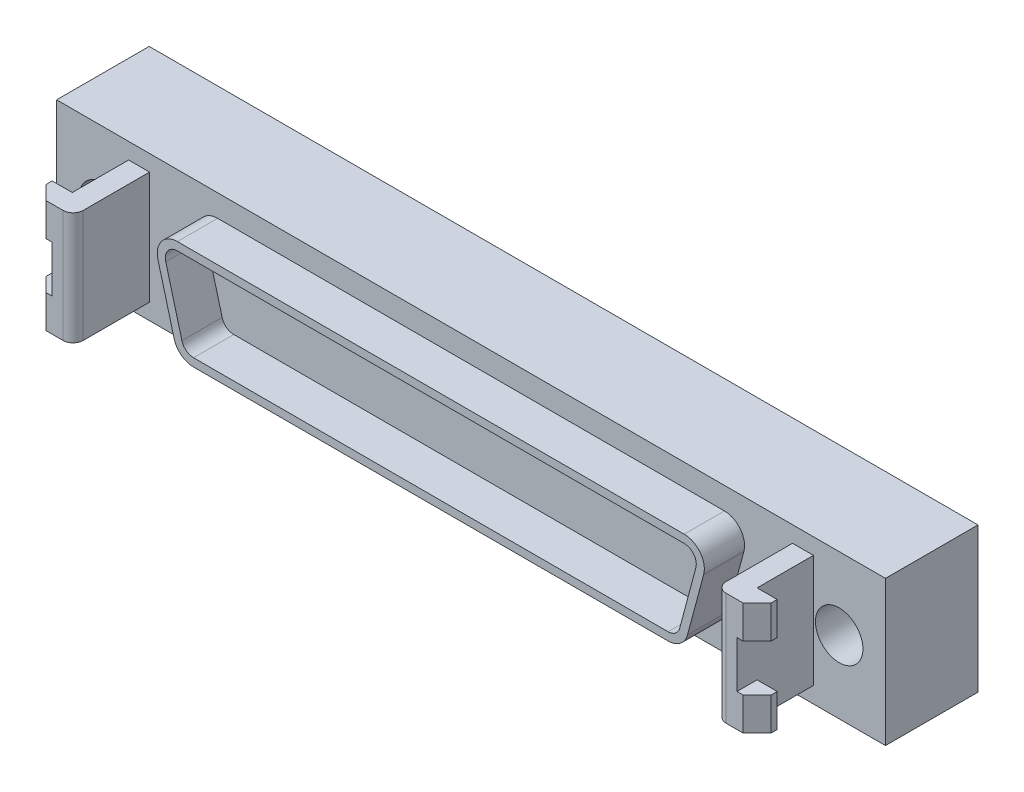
ISO-10303-21;
HEADER;
FILE_DESCRIPTION(('STEP AP214'),'2;1');
FILE_NAME('part.step','',(''),(''),'','','');
FILE_SCHEMA(('AUTOMOTIVE_DESIGN { 1 0 10303 214 1 1 1 1 }'));
ENDSEC;
DATA;
#1=APPLICATION_CONTEXT('core data for automotive mechanical design processes');
#2=APPLICATION_PROTOCOL_DEFINITION('international standard','automotive_design',2000,#1);
#3=PRODUCT_CONTEXT('',#1,'mechanical');
#4=PRODUCT('Part','Part','',(#3));
#5=PRODUCT_RELATED_PRODUCT_CATEGORY('part','',(#4));
#6=PRODUCT_DEFINITION_FORMATION('','',#4);
#7=PRODUCT_DEFINITION_CONTEXT('part definition',#1,'design');
#8=PRODUCT_DEFINITION('design','',#6,#7);
#9=PRODUCT_DEFINITION_SHAPE('','',#8);
#10=(LENGTH_UNIT() NAMED_UNIT(*) SI_UNIT(.MILLI.,.METRE.));
#11=(NAMED_UNIT(*) PLANE_ANGLE_UNIT() SI_UNIT($,.RADIAN.));
#12=(NAMED_UNIT(*) SI_UNIT($,.STERADIAN.) SOLID_ANGLE_UNIT());
#13=UNCERTAINTY_MEASURE_WITH_UNIT(LENGTH_MEASURE(1.E-05),#10,'distance_accuracy_value','');
#14=(GEOMETRIC_REPRESENTATION_CONTEXT(3) GLOBAL_UNCERTAINTY_ASSIGNED_CONTEXT((#13)) GLOBAL_UNIT_ASSIGNED_CONTEXT((#10,
#11,#12)) REPRESENTATION_CONTEXT('',''));
#15=CARTESIAN_POINT('',(0.,0.,0.));
#16=DIRECTION('',(0.,0.,1.));
#17=DIRECTION('',(1.,0.,0.));
#18=AXIS2_PLACEMENT_3D('',#15,#16,#17);
#19=CARTESIAN_POINT('',(20.9296,3.556,10.668));
#20=DIRECTION('',(0.,0.,1.));
#21=DIRECTION('',(1.,0.,0.));
#22=AXIS2_PLACEMENT_3D('',#19,#20,#21);
#23=PLANE('',#22);
#24=DIRECTION('',(0.,-1.,0.));
#25=VECTOR('',#24,1.);
#26=CARTESIAN_POINT('',(22.0069077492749,3.556,10.668));
#27=LINE('',#26,#25);
#28=CARTESIAN_POINT('',(22.0069077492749,-1.4732,10.668));
#29=VERTEX_POINT('',#28);
#30=CARTESIAN_POINT('',(22.0069077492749,-3.556,10.668));
#31=VERTEX_POINT('',#30);
#32=EDGE_CURVE('E406',#29,#31,#27,.T.);
#33=ORIENTED_EDGE('',*,*,#32,.F.);
#34=DIRECTION('',(1.,0.,0.));
#35=VECTOR('',#34,1.);
#36=CARTESIAN_POINT('',(21.6154,-1.4732,10.668));
#37=LINE('',#36,#35);
#38=CARTESIAN_POINT('',(21.6154,-1.4732,10.668));
#39=VERTEX_POINT('',#38);
#40=EDGE_CURVE('E1310',#39,#29,#37,.T.);
#41=ORIENTED_EDGE('',*,*,#40,.F.);
#42=DIRECTION('',(0.,-1.,0.));
#43=VECTOR('',#42,1.);
#44=CARTESIAN_POINT('',(21.6154,-1.4732,10.668));
#45=LINE('',#44,#43);
#46=CARTESIAN_POINT('',(21.6154,1.4732,10.668));
#47=VERTEX_POINT('',#46);
#48=EDGE_CURVE('E398',#47,#39,#45,.T.);
#49=ORIENTED_EDGE('',*,*,#48,.F.);
#50=DIRECTION('',(-1.,0.,0.));
#51=VECTOR('',#50,1.);
#52=CARTESIAN_POINT('',(21.6154,1.4732,10.668));
#53=LINE('',#52,#51);
#54=CARTESIAN_POINT('',(22.0069077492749,1.4732,10.668));
#55=VERTEX_POINT('',#54);
#56=EDGE_CURVE('E382',#55,#47,#53,.T.);
#57=ORIENTED_EDGE('',*,*,#56,.F.);
#58=CARTESIAN_POINT('',(22.0069077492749,3.556,10.668));
#59=VERTEX_POINT('',#58);
#60=EDGE_CURVE('E394',#59,#55,#27,.T.);
#61=ORIENTED_EDGE('',*,*,#60,.F.);
#62=DIRECTION('',(-1.,0.,0.));
#63=VECTOR('',#62,1.);
#64=CARTESIAN_POINT('',(20.9296,3.556,10.668));
#65=LINE('',#64,#63);
#66=CARTESIAN_POINT('',(20.9296,3.556,10.668));
#67=VERTEX_POINT('',#66);
#68=EDGE_CURVE('E1301',#59,#67,#65,.T.);
#69=ORIENTED_EDGE('',*,*,#68,.T.);
#70=DIRECTION('',(0.,-1.,0.));
#71=VECTOR('',#70,1.);
#72=CARTESIAN_POINT('',(20.9296,3.556,10.668));
#73=LINE('',#72,#71);
#74=CARTESIAN_POINT('',(20.9296,-3.556,10.668));
#75=VERTEX_POINT('',#74);
#76=EDGE_CURVE('E405',#67,#75,#73,.T.);
#77=ORIENTED_EDGE('',*,*,#76,.T.);
#78=DIRECTION('',(-1.,0.,0.));
#79=VECTOR('',#78,1.);
#80=CARTESIAN_POINT('',(20.9296,-3.556,10.668));
#81=LINE('',#80,#79);
#82=EDGE_CURVE('E1252',#31,#75,#81,.T.);
#83=ORIENTED_EDGE('',*,*,#82,.F.);
#84=EDGE_LOOP('',(#33,#41,#49,#57,#61,#69,#77,#83));
#85=FACE_BOUND('',#84,.T.);
#86=ADVANCED_FACE('F84',(#85),#23,.T.);
#87=CARTESIAN_POINT('',(22.0069077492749,3.556,10.668));
#88=DIRECTION('',(0.707106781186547,0.,0.707106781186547));
#89=DIRECTION('',(0.707106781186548,0.,-0.707106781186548));
#90=AXIS2_PLACEMENT_3D('',#87,#88,#89);
#91=PLANE('',#90);
#92=DIRECTION('',(0.,-1.,0.));
#93=VECTOR('',#92,1.);
#94=CARTESIAN_POINT('',(22.8854,3.556,9.78950774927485));
#95=LINE('',#94,#93);
#96=CARTESIAN_POINT('',(22.8854,-1.4732,9.78950774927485));
#97=VERTEX_POINT('',#96);
#98=CARTESIAN_POINT('',(22.8854,-3.556,9.78950774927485));
#99=VERTEX_POINT('',#98);
#100=EDGE_CURVE('E1280',#97,#99,#95,.T.);
#101=ORIENTED_EDGE('',*,*,#100,.F.);
#102=DIRECTION('',(0.707106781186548,0.,-0.707106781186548));
#103=VECTOR('',#102,1.);
#104=CARTESIAN_POINT('',(21.8106538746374,-1.4732,10.8642538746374));
#105=LINE('',#104,#103);
#106=EDGE_CURVE('E1314',#29,#97,#105,.T.);
#107=ORIENTED_EDGE('',*,*,#106,.F.);
#108=ORIENTED_EDGE('',*,*,#32,.T.);
#109=DIRECTION('',(-0.707106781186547,0.,0.707106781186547));
#110=VECTOR('',#109,1.);
#111=CARTESIAN_POINT('',(22.0069077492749,-3.556,10.668));
#112=LINE('',#111,#110);
#113=EDGE_CURVE('E1255',#99,#31,#112,.T.);
#114=ORIENTED_EDGE('',*,*,#113,.F.);
#115=EDGE_LOOP('',(#101,#107,#108,#114));
#116=FACE_BOUND('',#115,.T.);
#117=ADVANCED_FACE('F686',(#116),#91,.T.);
#118=ORIENTED_EDGE('',*,*,#60,.T.);
#119=DIRECTION('',(-0.707106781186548,0.,0.707106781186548));
#120=VECTOR('',#119,1.);
#121=CARTESIAN_POINT('',(21.8106538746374,1.4732,10.8642538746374));
#122=LINE('',#121,#120);
#123=CARTESIAN_POINT('',(22.8854,1.4732,9.78950774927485));
#124=VERTEX_POINT('',#123);
#125=EDGE_CURVE('E379',#124,#55,#122,.T.);
#126=ORIENTED_EDGE('',*,*,#125,.F.);
#127=CARTESIAN_POINT('',(22.8854,3.556,9.78950774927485));
#128=VERTEX_POINT('',#127);
#129=EDGE_CURVE('E410',#128,#124,#95,.T.);
#130=ORIENTED_EDGE('',*,*,#129,.F.);
#131=DIRECTION('',(-0.707106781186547,0.,0.707106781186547));
#132=VECTOR('',#131,1.);
#133=CARTESIAN_POINT('',(22.0069077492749,3.556,10.668));
#134=LINE('',#133,#132);
#135=EDGE_CURVE('E404',#128,#59,#134,.T.);
#136=ORIENTED_EDGE('',*,*,#135,.T.);
#137=EDGE_LOOP('',(#118,#126,#130,#136));
#138=FACE_BOUND('',#137,.T.);
#139=ADVANCED_FACE('F402',(#138),#91,.T.);
#140=CARTESIAN_POINT('',(22.8854,3.556,9.78950774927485));
#141=DIRECTION('',(1.,0.,0.));
#142=DIRECTION('',(0.,0.,-1.));
#143=AXIS2_PLACEMENT_3D('',#140,#141,#142);
#144=PLANE('',#143);
#145=DIRECTION('',(0.,-1.,0.));
#146=VECTOR('',#145,1.);
#147=CARTESIAN_POINT('',(22.8854,3.556,9.398));
#148=LINE('',#147,#146);
#149=CARTESIAN_POINT('',(22.8854,-1.4732,9.398));
#150=VERTEX_POINT('',#149);
#151=CARTESIAN_POINT('',(22.8854,-3.556,9.398));
#152=VERTEX_POINT('',#151);
#153=EDGE_CURVE('E1277',#150,#152,#148,.T.);
#154=ORIENTED_EDGE('',*,*,#153,.F.);
#155=DIRECTION('',(0.,0.,-1.));
#156=VECTOR('',#155,1.);
#157=CARTESIAN_POINT('',(22.8854,-1.4732,10.669));
#158=LINE('',#157,#156);
#159=EDGE_CURVE('E1290',#97,#150,#158,.T.);
#160=ORIENTED_EDGE('',*,*,#159,.F.);
#161=ORIENTED_EDGE('',*,*,#100,.T.);
#162=DIRECTION('',(0.,0.,1.));
#163=VECTOR('',#162,1.);
#164=CARTESIAN_POINT('',(22.8854,-3.556,9.78950774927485));
#165=LINE('',#164,#163);
#166=EDGE_CURVE('E1258',#152,#99,#165,.T.);
#167=ORIENTED_EDGE('',*,*,#166,.F.);
#168=EDGE_LOOP('',(#154,#160,#161,#167));
#169=FACE_BOUND('',#168,.T.);
#170=ADVANCED_FACE('F1035',(#169),#144,.T.);
#171=ORIENTED_EDGE('',*,*,#129,.T.);
#172=DIRECTION('',(0.,0.,-1.));
#173=VECTOR('',#172,1.);
#174=CARTESIAN_POINT('',(22.8854,1.4732,10.669));
#175=LINE('',#174,#173);
#176=CARTESIAN_POINT('',(22.8854,1.4732,9.398));
#177=VERTEX_POINT('',#176);
#178=EDGE_CURVE('E385',#124,#177,#175,.T.);
#179=ORIENTED_EDGE('',*,*,#178,.T.);
#180=CARTESIAN_POINT('',(22.8854,3.556,9.398));
#181=VERTEX_POINT('',#180);
#182=EDGE_CURVE('E1278',#181,#177,#148,.T.);
#183=ORIENTED_EDGE('',*,*,#182,.F.);
#184=DIRECTION('',(0.,0.,1.));
#185=VECTOR('',#184,1.);
#186=CARTESIAN_POINT('',(22.8854,3.556,9.78950774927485));
#187=LINE('',#186,#185);
#188=EDGE_CURVE('E1304',#181,#128,#187,.T.);
#189=ORIENTED_EDGE('',*,*,#188,.T.);
#190=EDGE_LOOP('',(#171,#179,#183,#189));
#191=FACE_BOUND('',#190,.T.);
#192=ADVANCED_FACE('F1042',(#191),#144,.T.);
#193=CARTESIAN_POINT('',(22.8854,3.556,9.398));
#194=DIRECTION('',(0.,0.,-1.));
#195=DIRECTION('',(-1.,0.,0.));
#196=AXIS2_PLACEMENT_3D('',#193,#194,#195);
#197=PLANE('',#196);
#198=DIRECTION('',(0.,-1.,0.));
#199=VECTOR('',#198,1.);
#200=CARTESIAN_POINT('',(21.6154,3.556,9.398));
#201=LINE('',#200,#199);
#202=CARTESIAN_POINT('',(21.6154,-1.4732,9.398));
#203=VERTEX_POINT('',#202);
#204=CARTESIAN_POINT('',(21.6154,-3.556,9.398));
#205=VERTEX_POINT('',#204);
#206=EDGE_CURVE('E1274',#203,#205,#201,.T.);
#207=ORIENTED_EDGE('',*,*,#206,.F.);
#208=DIRECTION('',(1.,0.,0.));
#209=VECTOR('',#208,1.);
#210=CARTESIAN_POINT('',(21.6154,-1.4732,9.398));
#211=LINE('',#210,#209);
#212=EDGE_CURVE('E99',#203,#150,#211,.T.);
#213=ORIENTED_EDGE('',*,*,#212,.T.);
#214=ORIENTED_EDGE('',*,*,#153,.T.);
#215=DIRECTION('',(1.,0.,0.));
#216=VECTOR('',#215,1.);
#217=CARTESIAN_POINT('',(22.8854,-3.556,9.398));
#218=LINE('',#217,#216);
#219=EDGE_CURVE('E1261',#205,#152,#218,.T.);
#220=ORIENTED_EDGE('',*,*,#219,.F.);
#221=EDGE_LOOP('',(#207,#213,#214,#220));
#222=FACE_BOUND('',#221,.T.);
#223=ADVANCED_FACE('F1050',(#222),#197,.T.);
#224=ORIENTED_EDGE('',*,*,#182,.T.);
#225=DIRECTION('',(-1.,0.,0.));
#226=VECTOR('',#225,1.);
#227=CARTESIAN_POINT('',(21.6154,1.4732,9.398));
#228=LINE('',#227,#226);
#229=CARTESIAN_POINT('',(21.6154,1.4732,9.398));
#230=VERTEX_POINT('',#229);
#231=EDGE_CURVE('E1309',#177,#230,#228,.T.);
#232=ORIENTED_EDGE('',*,*,#231,.T.);
#233=CARTESIAN_POINT('',(21.6154,3.556,9.398));
#234=VERTEX_POINT('',#233);
#235=EDGE_CURVE('E1275',#234,#230,#201,.T.);
#236=ORIENTED_EDGE('',*,*,#235,.F.);
#237=DIRECTION('',(1.,0.,0.));
#238=VECTOR('',#237,1.);
#239=CARTESIAN_POINT('',(22.8854,3.556,9.398));
#240=LINE('',#239,#238);
#241=EDGE_CURVE('E1247',#234,#181,#240,.T.);
#242=ORIENTED_EDGE('',*,*,#241,.T.);
#243=EDGE_LOOP('',(#224,#232,#236,#242));
#244=FACE_BOUND('',#243,.T.);
#245=ADVANCED_FACE('F1058',(#244),#197,.T.);
#246=CARTESIAN_POINT('',(-22.8854,3.556,9.398));
#247=DIRECTION('',(0.,0.,1.));
#248=DIRECTION('',(1.,0.,0.));
#249=AXIS2_PLACEMENT_3D('',#246,#247,#248);
#250=PLANE('',#249);
#251=DIRECTION('',(0.,-1.,0.));
#252=VECTOR('',#251,1.);
#253=CARTESIAN_POINT('',(-21.6154,3.556,9.398));
#254=LINE('',#253,#252);
#255=CARTESIAN_POINT('',(-21.6154,3.556,9.398));
#256=VERTEX_POINT('',#255);
#257=CARTESIAN_POINT('',(-21.6154,1.4732,9.398));
#258=VERTEX_POINT('',#257);
#259=EDGE_CURVE('E494',#256,#258,#254,.T.);
#260=ORIENTED_EDGE('',*,*,#259,.T.);
#261=DIRECTION('',(1.,0.,0.));
#262=VECTOR('',#261,1.);
#263=CARTESIAN_POINT('',(-21.6154,1.4732,9.398));
#264=LINE('',#263,#262);
#265=CARTESIAN_POINT('',(-22.8854,1.4732,9.398));
#266=VERTEX_POINT('',#265);
#267=EDGE_CURVE('E422',#266,#258,#264,.T.);
#268=ORIENTED_EDGE('',*,*,#267,.F.);
#269=DIRECTION('',(0.,-1.,0.));
#270=VECTOR('',#269,1.);
#271=CARTESIAN_POINT('',(-22.8854,3.556,9.398));
#272=LINE('',#271,#270);
#273=CARTESIAN_POINT('',(-22.8854,3.556,9.398));
#274=VERTEX_POINT('',#273);
#275=EDGE_CURVE('E490',#274,#266,#272,.T.);
#276=ORIENTED_EDGE('',*,*,#275,.F.);
#277=DIRECTION('',(-1.,0.,0.));
#278=VECTOR('',#277,1.);
#279=CARTESIAN_POINT('',(-22.8854,3.556,9.398));
#280=LINE('',#279,#278);
#281=EDGE_CURVE('E450',#256,#274,#280,.T.);
#282=ORIENTED_EDGE('',*,*,#281,.F.);
#283=EDGE_LOOP('',(#260,#268,#276,#282));
#284=FACE_BOUND('',#283,.T.);
#285=ADVANCED_FACE('F735',(#284),#250,.F.);
#286=CARTESIAN_POINT('',(-22.8854,3.556,9.78950774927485));
#287=DIRECTION('',(1.,0.,0.));
#288=DIRECTION('',(0.,0.,-1.));
#289=AXIS2_PLACEMENT_3D('',#286,#287,#288);
#290=PLANE('',#289);
#291=ORIENTED_EDGE('',*,*,#275,.T.);
#292=DIRECTION('',(0.,0.,-1.));
#293=VECTOR('',#292,1.);
#294=CARTESIAN_POINT('',(-22.8854,1.4732,10.669));
#295=LINE('',#294,#293);
#296=CARTESIAN_POINT('',(-22.8854,1.4732,9.78950774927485));
#297=VERTEX_POINT('',#296);
#298=EDGE_CURVE('E429',#297,#266,#295,.T.);
#299=ORIENTED_EDGE('',*,*,#298,.F.);
#300=DIRECTION('',(0.,-1.,0.));
#301=VECTOR('',#300,1.);
#302=CARTESIAN_POINT('',(-22.8854,3.556,9.78950774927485));
#303=LINE('',#302,#301);
#304=CARTESIAN_POINT('',(-22.8854,3.556,9.78950774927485));
#305=VERTEX_POINT('',#304);
#306=EDGE_CURVE('E486',#305,#297,#303,.T.);
#307=ORIENTED_EDGE('',*,*,#306,.F.);
#308=DIRECTION('',(0.,0.,1.));
#309=VECTOR('',#308,1.);
#310=CARTESIAN_POINT('',(-22.8854,3.556,9.78950774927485));
#311=LINE('',#310,#309);
#312=EDGE_CURVE('E452',#274,#305,#311,.T.);
#313=ORIENTED_EDGE('',*,*,#312,.F.);
#314=EDGE_LOOP('',(#291,#299,#307,#313));
#315=FACE_BOUND('',#314,.T.);
#316=ADVANCED_FACE('F730',(#315),#290,.F.);
#317=CARTESIAN_POINT('',(-22.0069077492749,3.556,10.668));
#318=DIRECTION('',(0.707106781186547,0.,-0.707106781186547));
#319=DIRECTION('',(-0.707106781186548,0.,-0.707106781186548));
#320=AXIS2_PLACEMENT_3D('',#317,#318,#319);
#321=PLANE('',#320);
#322=ORIENTED_EDGE('',*,*,#306,.T.);
#323=DIRECTION('',(-0.707106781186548,0.,-0.707106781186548));
#324=VECTOR('',#323,1.);
#325=CARTESIAN_POINT('',(-21.8106538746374,1.4732,10.8642538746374));
#326=LINE('',#325,#324);
#327=CARTESIAN_POINT('',(-22.0069077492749,1.4732,10.668));
#328=VERTEX_POINT('',#327);
#329=EDGE_CURVE('E418',#328,#297,#326,.T.);
#330=ORIENTED_EDGE('',*,*,#329,.F.);
#331=DIRECTION('',(0.,-1.,0.));
#332=VECTOR('',#331,1.);
#333=CARTESIAN_POINT('',(-22.0069077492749,3.556,10.668));
#334=LINE('',#333,#332);
#335=CARTESIAN_POINT('',(-22.0069077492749,3.556,10.668));
#336=VERTEX_POINT('',#335);
#337=EDGE_CURVE('E482',#336,#328,#334,.T.);
#338=ORIENTED_EDGE('',*,*,#337,.F.);
#339=DIRECTION('',(0.707106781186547,0.,0.707106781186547));
#340=VECTOR('',#339,1.);
#341=CARTESIAN_POINT('',(-22.0069077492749,3.556,10.668));
#342=LINE('',#341,#340);
#343=EDGE_CURVE('E454',#305,#336,#342,.T.);
#344=ORIENTED_EDGE('',*,*,#343,.F.);
#345=EDGE_LOOP('',(#322,#330,#338,#344));
#346=FACE_BOUND('',#345,.T.);
#347=ADVANCED_FACE('F725',(#346),#321,.F.);
#348=CARTESIAN_POINT('',(-26.162,-4.57199999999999,5.842));
#349=DIRECTION('',(0.,0.,1.));
#350=DIRECTION('',(1.,0.,0.));
#351=AXIS2_PLACEMENT_3D('',#348,#349,#350);
#352=PLANE('',#351);
#353=DIRECTION('',(1.,0.,0.));
#354=VECTOR('',#353,1.);
#355=CARTESIAN_POINT('',(21.6154,3.556,5.842));
#356=LINE('',#355,#354);
#357=CARTESIAN_POINT('',(20.2946,3.556,5.842));
#358=VERTEX_POINT('',#357);
#359=CARTESIAN_POINT('',(21.6154,3.556,5.842));
#360=VERTEX_POINT('',#359);
#361=EDGE_CURVE('E1234',#358,#360,#356,.T.);
#362=ORIENTED_EDGE('',*,*,#361,.T.);
#363=DIRECTION('',(0.,-1.,0.));
#364=VECTOR('',#363,1.);
#365=CARTESIAN_POINT('',(21.6154,3.556,5.842));
#366=LINE('',#365,#364);
#367=CARTESIAN_POINT('',(21.6154,-3.556,5.842));
#368=VERTEX_POINT('',#367);
#369=EDGE_CURVE('E1236',#360,#368,#366,.T.);
#370=ORIENTED_EDGE('',*,*,#369,.T.);
#371=DIRECTION('',(1.,0.,0.));
#372=VECTOR('',#371,1.);
#373=CARTESIAN_POINT('',(21.6154,-3.556,5.842));
#374=LINE('',#373,#372);
#375=CARTESIAN_POINT('',(20.2946,-3.556,5.842));
#376=VERTEX_POINT('',#375);
#377=EDGE_CURVE('E1267',#376,#368,#374,.T.);
#378=ORIENTED_EDGE('',*,*,#377,.F.);
#379=DIRECTION('',(0.,-1.,0.));
#380=VECTOR('',#379,1.);
#381=CARTESIAN_POINT('',(20.2946,3.556,5.842));
#382=LINE('',#381,#380);
#383=EDGE_CURVE('E1237',#358,#376,#382,.T.);
#384=ORIENTED_EDGE('',*,*,#383,.F.);
#385=EDGE_LOOP('',(#362,#370,#378,#384));
#386=FACE_BOUND('',#385,.T.);
#387=DIRECTION('',(-1.,0.,0.));
#388=VECTOR('',#387,1.);
#389=CARTESIAN_POINT('',(-21.6154,3.556,5.842));
#390=LINE('',#389,#388);
#391=CARTESIAN_POINT('',(-20.2946,3.556,5.842));
#392=VERTEX_POINT('',#391);
#393=CARTESIAN_POINT('',(-21.6154,3.556,5.842));
#394=VERTEX_POINT('',#393);
#395=EDGE_CURVE('E446',#392,#394,#390,.T.);
#396=ORIENTED_EDGE('',*,*,#395,.F.);
#397=DIRECTION('',(0.,-1.,0.));
#398=VECTOR('',#397,1.);
#399=CARTESIAN_POINT('',(-20.2946,3.556,5.842));
#400=LINE('',#399,#398);
#401=CARTESIAN_POINT('',(-20.2946,-3.556,5.842));
#402=VERTEX_POINT('',#401);
#403=EDGE_CURVE('E500',#392,#402,#400,.T.);
#404=ORIENTED_EDGE('',*,*,#403,.T.);
#405=DIRECTION('',(-1.,0.,0.));
#406=VECTOR('',#405,1.);
#407=CARTESIAN_POINT('',(-21.6154,-3.556,5.842));
#408=LINE('',#407,#406);
#409=CARTESIAN_POINT('',(-21.6154,-3.556,5.842));
#410=VERTEX_POINT('',#409);
#411=EDGE_CURVE('E463',#402,#410,#408,.T.);
#412=ORIENTED_EDGE('',*,*,#411,.T.);
#413=DIRECTION('',(0.,-1.,0.));
#414=VECTOR('',#413,1.);
#415=CARTESIAN_POINT('',(-21.6154,3.556,5.842));
#416=LINE('',#415,#414);
#417=EDGE_CURVE('E497',#394,#410,#416,.T.);
#418=ORIENTED_EDGE('',*,*,#417,.F.);
#419=EDGE_LOOP('',(#396,#404,#412,#418));
#420=FACE_BOUND('',#419,.T.);
#421=CARTESIAN_POINT('',(-23.241,0.,5.842));
#422=DIRECTION('',(0.,0.,1.));
#423=DIRECTION('',(1.,0.,0.));
#424=AXIS2_PLACEMENT_3D('',#421,#422,#423);
#425=CIRCLE('',#424,1.4986);
#426=CARTESIAN_POINT('',(-21.7424,0.,5.842));
#427=VERTEX_POINT('',#426);
#428=EDGE_CURVE('E627',#427,#427,#425,.T.);
#429=ORIENTED_EDGE('',*,*,#428,.F.);
#430=EDGE_LOOP('',(#429));
#431=FACE_BOUND('',#430,.T.);
#432=DIRECTION('',(0.,-1.,0.));
#433=VECTOR('',#432,1.);
#434=CARTESIAN_POINT('',(-26.162,4.57199999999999,5.842));
#435=LINE('',#434,#433);
#436=CARTESIAN_POINT('',(-26.162,4.57199999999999,5.842));
#437=VERTEX_POINT('',#436);
#438=CARTESIAN_POINT('',(-26.162,-4.57199999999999,5.842));
#439=VERTEX_POINT('',#438);
#440=EDGE_CURVE('E633',#437,#439,#435,.T.);
#441=ORIENTED_EDGE('',*,*,#440,.T.);
#442=DIRECTION('',(1.,0.,0.));
#443=VECTOR('',#442,1.);
#444=CARTESIAN_POINT('',(-26.162,-4.57199999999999,5.842));
#445=LINE('',#444,#443);
#446=CARTESIAN_POINT('',(26.162,-4.57199999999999,5.842));
#447=VERTEX_POINT('',#446);
#448=EDGE_CURVE('E636',#439,#447,#445,.T.);
#449=ORIENTED_EDGE('',*,*,#448,.T.);
#450=DIRECTION('',(0.,1.,0.));
#451=VECTOR('',#450,1.);
#452=CARTESIAN_POINT('',(26.162,4.57199999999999,5.842));
#453=LINE('',#452,#451);
#454=CARTESIAN_POINT('',(26.162,4.57199999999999,5.842));
#455=VERTEX_POINT('',#454);
#456=EDGE_CURVE('E639',#447,#455,#453,.T.);
#457=ORIENTED_EDGE('',*,*,#456,.T.);
#458=DIRECTION('',(-1.,0.,0.));
#459=VECTOR('',#458,1.);
#460=CARTESIAN_POINT('',(-26.162,4.57199999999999,5.842));
#461=LINE('',#460,#459);
#462=EDGE_CURVE('E641',#455,#437,#461,.T.);
#463=ORIENTED_EDGE('',*,*,#462,.T.);
#464=EDGE_LOOP('',(#441,#449,#457,#463));
#465=FACE_BOUND('',#464,.T.);
#466=CARTESIAN_POINT('',(23.241,0.,5.842));
#467=DIRECTION('',(0.,0.,1.));
#468=DIRECTION('',(1.,0.,0.));
#469=AXIS2_PLACEMENT_3D('',#466,#467,#468);
#470=CIRCLE('',#469,1.4986);
#471=CARTESIAN_POINT('',(24.7396,0.,5.842));
#472=VERTEX_POINT('',#471);
#473=EDGE_CURVE('E621',#472,#472,#470,.T.);
#474=ORIENTED_EDGE('',*,*,#473,.F.);
#475=EDGE_LOOP('',(#474));
#476=FACE_BOUND('',#475,.T.);
#477=DIRECTION('',(0.258819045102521,-0.965925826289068,0.));
#478=VECTOR('',#477,1.);
#479=CARTESIAN_POINT('',(-17.2246295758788,1.5762998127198,5.842));
#480=LINE('',#479,#478);
#481=CARTESIAN_POINT('',(-17.2246295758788,1.5762998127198,5.842));
#482=VERTEX_POINT('',#481);
#483=CARTESIAN_POINT('',(-16.2037431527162,-2.2337001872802,5.842));
#484=VERTEX_POINT('',#483);
#485=EDGE_CURVE('E585',#482,#484,#480,.T.);
#486=ORIENTED_EDGE('',*,*,#485,.F.);
#487=CARTESIAN_POINT('',(-15.9979037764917,1.905,5.842));
#488=DIRECTION('',(0.,0.,1.));
#489=DIRECTION('',(-1.,0.,0.));
#490=AXIS2_PLACEMENT_3D('',#487,#488,#489);
#491=CIRCLE('',#490,1.27);
#492=CARTESIAN_POINT('',(-15.9979037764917,3.175,5.842));
#493=VERTEX_POINT('',#492);
#494=EDGE_CURVE('E563',#493,#482,#491,.T.);
#495=ORIENTED_EDGE('',*,*,#494,.F.);
#496=DIRECTION('',(-1.,0.,0.));
#497=VECTOR('',#496,1.);
#498=CARTESIAN_POINT('',(-15.9979037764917,3.175,5.842));
#499=LINE('',#498,#497);
#500=CARTESIAN_POINT('',(15.9979037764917,3.175,5.842));
#501=VERTEX_POINT('',#500);
#502=EDGE_CURVE('E568',#501,#493,#499,.T.);
#503=ORIENTED_EDGE('',*,*,#502,.F.);
#504=CARTESIAN_POINT('',(15.9979037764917,1.905,5.842));
#505=DIRECTION('',(0.,0.,1.));
#506=DIRECTION('',(1.,0.,0.));
#507=AXIS2_PLACEMENT_3D('',#504,#505,#506);
#508=CIRCLE('',#507,1.27);
#509=CARTESIAN_POINT('',(17.2246295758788,1.5762998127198,5.842));
#510=VERTEX_POINT('',#509);
#511=EDGE_CURVE('E595',#510,#501,#508,.T.);
#512=ORIENTED_EDGE('',*,*,#511,.F.);
#513=DIRECTION('',(0.258819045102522,0.965925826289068,0.));
#514=VECTOR('',#513,1.);
#515=CARTESIAN_POINT('',(17.2246295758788,1.5762998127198,5.842));
#516=LINE('',#515,#514);
#517=CARTESIAN_POINT('',(16.2037431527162,-2.2337001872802,5.842));
#518=VERTEX_POINT('',#517);
#519=EDGE_CURVE('E593',#518,#510,#516,.T.);
#520=ORIENTED_EDGE('',*,*,#519,.F.);
#521=CARTESIAN_POINT('',(14.9770173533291,-1.905,5.842));
#522=DIRECTION('',(0.,0.,1.));
#523=DIRECTION('',(-1.,0.,0.));
#524=AXIS2_PLACEMENT_3D('',#521,#522,#523);
#525=CIRCLE('',#524,1.27);
#526=CARTESIAN_POINT('',(14.9770173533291,-3.175,5.842));
#527=VERTEX_POINT('',#526);
#528=EDGE_CURVE('E591',#527,#518,#525,.T.);
#529=ORIENTED_EDGE('',*,*,#528,.F.);
#530=DIRECTION('',(1.,0.,0.));
#531=VECTOR('',#530,1.);
#532=CARTESIAN_POINT('',(14.9770173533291,-3.175,5.842));
#533=LINE('',#532,#531);
#534=CARTESIAN_POINT('',(-14.9770173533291,-3.175,5.842));
#535=VERTEX_POINT('',#534);
#536=EDGE_CURVE('E589',#535,#527,#533,.T.);
#537=ORIENTED_EDGE('',*,*,#536,.F.);
#538=CARTESIAN_POINT('',(-14.9770173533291,-1.905,5.842));
#539=DIRECTION('',(0.,0.,1.));
#540=DIRECTION('',(-1.,0.,0.));
#541=AXIS2_PLACEMENT_3D('',#538,#539,#540);
#542=CIRCLE('',#541,1.27);
#543=EDGE_CURVE('E587',#484,#535,#542,.T.);
#544=ORIENTED_EDGE('',*,*,#543,.F.);
#545=EDGE_LOOP('',(#486,#495,#503,#512,#520,#529,#537,#544));
#546=FACE_BOUND('',#545,.T.);
#547=ADVANCED_FACE('F676',(#386,#420,#431,#465,#476,#546),#352,.T.);
#548=CARTESIAN_POINT('',(-26.162,-4.57199999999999,0.));
#549=DIRECTION('',(0.,0.,1.));
#550=DIRECTION('',(1.,0.,0.));
#551=AXIS2_PLACEMENT_3D('',#548,#549,#550);
#552=PLANE('',#551);
#553=CARTESIAN_POINT('',(-23.241,0.,0.));
#554=DIRECTION('',(0.,0.,1.));
#555=DIRECTION('',(1.,0.,0.));
#556=AXIS2_PLACEMENT_3D('',#553,#554,#555);
#557=CIRCLE('',#556,1.4986);
#558=CARTESIAN_POINT('',(-21.7424,0.,0.));
#559=VERTEX_POINT('',#558);
#560=EDGE_CURVE('E624',#559,#559,#557,.T.);
#561=ORIENTED_EDGE('',*,*,#560,.T.);
#562=EDGE_LOOP('',(#561));
#563=FACE_BOUND('',#562,.T.);
#564=DIRECTION('',(0.,-1.,0.));
#565=VECTOR('',#564,1.);
#566=CARTESIAN_POINT('',(-26.162,4.57199999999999,0.));
#567=LINE('',#566,#565);
#568=CARTESIAN_POINT('',(-26.162,4.57199999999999,0.));
#569=VERTEX_POINT('',#568);
#570=CARTESIAN_POINT('',(-26.162,-4.57199999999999,0.));
#571=VERTEX_POINT('',#570);
#572=EDGE_CURVE('E630',#569,#571,#567,.T.);
#573=ORIENTED_EDGE('',*,*,#572,.F.);
#574=DIRECTION('',(-1.,0.,0.));
#575=VECTOR('',#574,1.);
#576=CARTESIAN_POINT('',(-26.162,4.57199999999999,0.));
#577=LINE('',#576,#575);
#578=CARTESIAN_POINT('',(26.162,4.57199999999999,0.));
#579=VERTEX_POINT('',#578);
#580=EDGE_CURVE('E637',#579,#569,#577,.T.);
#581=ORIENTED_EDGE('',*,*,#580,.F.);
#582=DIRECTION('',(0.,1.,0.));
#583=VECTOR('',#582,1.);
#584=CARTESIAN_POINT('',(26.162,4.57199999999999,0.));
#585=LINE('',#584,#583);
#586=CARTESIAN_POINT('',(26.162,-4.57199999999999,0.));
#587=VERTEX_POINT('',#586);
#588=EDGE_CURVE('E648',#587,#579,#585,.T.);
#589=ORIENTED_EDGE('',*,*,#588,.F.);
#590=DIRECTION('',(1.,0.,0.));
#591=VECTOR('',#590,1.);
#592=CARTESIAN_POINT('',(-26.162,-4.57199999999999,0.));
#593=LINE('',#592,#591);
#594=EDGE_CURVE('E646',#571,#587,#593,.T.);
#595=ORIENTED_EDGE('',*,*,#594,.F.);
#596=EDGE_LOOP('',(#573,#581,#589,#595));
#597=FACE_BOUND('',#596,.T.);
#598=CARTESIAN_POINT('',(23.241,0.,0.));
#599=DIRECTION('',(0.,0.,1.));
#600=DIRECTION('',(1.,0.,0.));
#601=AXIS2_PLACEMENT_3D('',#598,#599,#600);
#602=CIRCLE('',#601,1.4986);
#603=CARTESIAN_POINT('',(24.7396,0.,0.));
#604=VERTEX_POINT('',#603);
#605=EDGE_CURVE('E620',#604,#604,#602,.T.);
#606=ORIENTED_EDGE('',*,*,#605,.T.);
#607=EDGE_LOOP('',(#606));
#608=FACE_BOUND('',#607,.T.);
#609=ADVANCED_FACE('F666',(#563,#597,#608),#552,.F.);
#610=CARTESIAN_POINT('',(-26.162,4.57199999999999,5.842));
#611=DIRECTION('',(1.,0.,0.));
#612=DIRECTION('',(0.,0.,-1.));
#613=AXIS2_PLACEMENT_3D('',#610,#611,#612);
#614=PLANE('',#613);
#615=ORIENTED_EDGE('',*,*,#572,.T.);
#616=DIRECTION('',(0.,0.,-1.));
#617=VECTOR('',#616,1.);
#618=CARTESIAN_POINT('',(-26.162,-4.57199999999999,5.842));
#619=LINE('',#618,#617);
#620=EDGE_CURVE('E12',#439,#571,#619,.T.);
#621=ORIENTED_EDGE('',*,*,#620,.F.);
#622=ORIENTED_EDGE('',*,*,#440,.F.);
#623=DIRECTION('',(0.,0.,-1.));
#624=VECTOR('',#623,1.);
#625=CARTESIAN_POINT('',(-26.162,4.57199999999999,5.842));
#626=LINE('',#625,#624);
#627=EDGE_CURVE('E643',#437,#569,#626,.T.);
#628=ORIENTED_EDGE('',*,*,#627,.T.);
#629=EDGE_LOOP('',(#615,#621,#622,#628));
#630=FACE_BOUND('',#629,.T.);
#631=ADVANCED_FACE('F86',(#630),#614,.F.);
#632=CARTESIAN_POINT('',(-26.162,-4.57199999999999,5.842));
#633=DIRECTION('',(0.,1.,0.));
#634=DIRECTION('',(0.,0.,1.));
#635=AXIS2_PLACEMENT_3D('',#632,#633,#634);
#636=PLANE('',#635);
#637=ORIENTED_EDGE('',*,*,#594,.T.);
#638=DIRECTION('',(0.,0.,-1.));
#639=VECTOR('',#638,1.);
#640=CARTESIAN_POINT('',(26.162,-4.57199999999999,5.842));
#641=LINE('',#640,#639);
#642=EDGE_CURVE('E92',#447,#587,#641,.T.);
#643=ORIENTED_EDGE('',*,*,#642,.F.);
#644=ORIENTED_EDGE('',*,*,#448,.F.);
#645=ORIENTED_EDGE('',*,*,#620,.T.);
#646=EDGE_LOOP('',(#637,#643,#644,#645));
#647=FACE_BOUND('',#646,.T.);
#648=ADVANCED_FACE('F678',(#647),#636,.F.);
#649=CARTESIAN_POINT('',(26.162,4.57199999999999,5.842));
#650=DIRECTION('',(-1.,0.,0.));
#651=DIRECTION('',(0.,0.,1.));
#652=AXIS2_PLACEMENT_3D('',#649,#650,#651);
#653=PLANE('',#652);
#654=ORIENTED_EDGE('',*,*,#588,.T.);
#655=DIRECTION('',(0.,0.,-1.));
#656=VECTOR('',#655,1.);
#657=CARTESIAN_POINT('',(26.162,4.57199999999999,5.842));
#658=LINE('',#657,#656);
#659=EDGE_CURVE('E653',#455,#579,#658,.T.);
#660=ORIENTED_EDGE('',*,*,#659,.F.);
#661=ORIENTED_EDGE('',*,*,#456,.F.);
#662=ORIENTED_EDGE('',*,*,#642,.T.);
#663=EDGE_LOOP('',(#654,#660,#661,#662));
#664=FACE_BOUND('',#663,.T.);
#665=ADVANCED_FACE('F660',(#664),#653,.F.);
#666=CARTESIAN_POINT('',(-26.162,4.57199999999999,5.842));
#667=DIRECTION('',(0.,-1.,0.));
#668=DIRECTION('',(0.,0.,-1.));
#669=AXIS2_PLACEMENT_3D('',#666,#667,#668);
#670=PLANE('',#669);
#671=ORIENTED_EDGE('',*,*,#580,.T.);
#672=ORIENTED_EDGE('',*,*,#627,.F.);
#673=ORIENTED_EDGE('',*,*,#462,.F.);
#674=ORIENTED_EDGE('',*,*,#659,.T.);
#675=EDGE_LOOP('',(#671,#672,#673,#674));
#676=FACE_BOUND('',#675,.T.);
#677=ADVANCED_FACE('F670',(#676),#670,.F.);
#678=CARTESIAN_POINT('',(-23.241,0.,5.842));
#679=DIRECTION('',(0.,0.,-1.));
#680=DIRECTION('',(-1.,0.,0.));
#681=AXIS2_PLACEMENT_3D('',#678,#679,#680);
#682=CYLINDRICAL_SURFACE('',#681,1.4986);
#683=ORIENTED_EDGE('',*,*,#428,.T.);
#684=EDGE_LOOP('',(#683));
#685=FACE_BOUND('',#684,.T.);
#686=ORIENTED_EDGE('',*,*,#560,.F.);
#687=EDGE_LOOP('',(#686));
#688=FACE_BOUND('',#687,.T.);
#689=ADVANCED_FACE('F819',(#685,#688),#682,.F.);
#690=CARTESIAN_POINT('',(23.241,0.,5.842));
#691=DIRECTION('',(0.,0.,-1.));
#692=DIRECTION('',(-1.,0.,0.));
#693=AXIS2_PLACEMENT_3D('',#690,#691,#692);
#694=CYLINDRICAL_SURFACE('',#693,1.4986);
#695=ORIENTED_EDGE('',*,*,#473,.T.);
#696=EDGE_LOOP('',(#695));
#697=FACE_BOUND('',#696,.T.);
#698=ORIENTED_EDGE('',*,*,#605,.F.);
#699=EDGE_LOOP('',(#698));
#700=FACE_BOUND('',#699,.T.);
#701=ADVANCED_FACE('F785',(#697,#700),#694,.F.);
#702=CARTESIAN_POINT('',(-15.9979037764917,1.905,8.382));
#703=DIRECTION('',(0.,0.,1.));
#704=DIRECTION('',(1.,0.,0.));
#705=AXIS2_PLACEMENT_3D('',#702,#703,#704);
#706=PLANE('',#705);
#707=CARTESIAN_POINT('',(-15.9979037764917,1.905,8.382));
#708=DIRECTION('',(0.,0.,1.));
#709=DIRECTION('',(-1.,0.,0.));
#710=AXIS2_PLACEMENT_3D('',#707,#708,#709);
#711=CIRCLE('',#710,1.27);
#712=CARTESIAN_POINT('',(-15.9979037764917,3.175,8.382));
#713=VERTEX_POINT('',#712);
#714=CARTESIAN_POINT('',(-17.2246295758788,1.5762998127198,8.382));
#715=VERTEX_POINT('',#714);
#716=EDGE_CURVE('E564',#713,#715,#711,.T.);
#717=ORIENTED_EDGE('',*,*,#716,.T.);
#718=DIRECTION('',(0.258819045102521,-0.965925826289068,0.));
#719=VECTOR('',#718,1.);
#720=CARTESIAN_POINT('',(-17.2246295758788,1.5762998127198,8.382));
#721=LINE('',#720,#719);
#722=CARTESIAN_POINT('',(-16.2037431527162,-2.2337001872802,8.382));
#723=VERTEX_POINT('',#722);
#724=EDGE_CURVE('E567',#715,#723,#721,.T.);
#725=ORIENTED_EDGE('',*,*,#724,.T.);
#726=CARTESIAN_POINT('',(-14.9770173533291,-1.905,8.382));
#727=DIRECTION('',(0.,0.,1.));
#728=DIRECTION('',(-1.,0.,0.));
#729=AXIS2_PLACEMENT_3D('',#726,#727,#728);
#730=CIRCLE('',#729,1.27);
#731=CARTESIAN_POINT('',(-14.9770173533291,-3.175,8.382));
#732=VERTEX_POINT('',#731);
#733=EDGE_CURVE('E570',#723,#732,#730,.T.);
#734=ORIENTED_EDGE('',*,*,#733,.T.);
#735=DIRECTION('',(1.,0.,0.));
#736=VECTOR('',#735,1.);
#737=CARTESIAN_POINT('',(14.9770173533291,-3.175,8.382));
#738=LINE('',#737,#736);
#739=CARTESIAN_POINT('',(14.9770173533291,-3.175,8.382));
#740=VERTEX_POINT('',#739);
#741=EDGE_CURVE('E572',#732,#740,#738,.T.);
#742=ORIENTED_EDGE('',*,*,#741,.T.);
#743=CARTESIAN_POINT('',(14.9770173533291,-1.905,8.382));
#744=DIRECTION('',(0.,0.,1.));
#745=DIRECTION('',(-1.,0.,0.));
#746=AXIS2_PLACEMENT_3D('',#743,#744,#745);
#747=CIRCLE('',#746,1.27);
#748=CARTESIAN_POINT('',(16.2037431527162,-2.2337001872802,8.382));
#749=VERTEX_POINT('',#748);
#750=EDGE_CURVE('E574',#740,#749,#747,.T.);
#751=ORIENTED_EDGE('',*,*,#750,.T.);
#752=DIRECTION('',(0.258819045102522,0.965925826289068,0.));
#753=VECTOR('',#752,1.);
#754=CARTESIAN_POINT('',(17.2246295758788,1.5762998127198,8.382));
#755=LINE('',#754,#753);
#756=CARTESIAN_POINT('',(17.2246295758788,1.5762998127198,8.382));
#757=VERTEX_POINT('',#756);
#758=EDGE_CURVE('E576',#749,#757,#755,.T.);
#759=ORIENTED_EDGE('',*,*,#758,.T.);
#760=CARTESIAN_POINT('',(15.9979037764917,1.905,8.382));
#761=DIRECTION('',(0.,0.,1.));
#762=DIRECTION('',(1.,0.,0.));
#763=AXIS2_PLACEMENT_3D('',#760,#761,#762);
#764=CIRCLE('',#763,1.27);
#765=CARTESIAN_POINT('',(15.9979037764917,3.175,8.382));
#766=VERTEX_POINT('',#765);
#767=EDGE_CURVE('E578',#757,#766,#764,.T.);
#768=ORIENTED_EDGE('',*,*,#767,.T.);
#769=DIRECTION('',(-1.,0.,0.));
#770=VECTOR('',#769,1.);
#771=CARTESIAN_POINT('',(-15.9979037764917,3.175,8.382));
#772=LINE('',#771,#770);
#773=EDGE_CURVE('E580',#766,#713,#772,.T.);
#774=ORIENTED_EDGE('',*,*,#773,.T.);
#775=EDGE_LOOP('',(#717,#725,#734,#742,#751,#759,#768,#774));
#776=FACE_BOUND('',#775,.T.);
#777=DIRECTION('',(0.258819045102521,-0.965925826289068,0.));
#778=VECTOR('',#777,1.);
#779=CARTESIAN_POINT('',(-16.7339392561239,1.70777988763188,8.382));
#780=LINE('',#779,#778);
#781=CARTESIAN_POINT('',(-16.7339392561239,1.70777988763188,8.382));
#782=VERTEX_POINT('',#781);
#783=CARTESIAN_POINT('',(-15.7130528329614,-2.10222011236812,8.382));
#784=VERTEX_POINT('',#783);
#785=EDGE_CURVE('E509',#782,#784,#780,.T.);
#786=ORIENTED_EDGE('',*,*,#785,.F.);
#787=CARTESIAN_POINT('',(-15.9979037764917,1.905,8.382));
#788=DIRECTION('',(0.,0.,-1.));
#789=DIRECTION('',(-1.,0.,0.));
#790=AXIS2_PLACEMENT_3D('',#787,#788,#789);
#791=CIRCLE('',#790,0.762000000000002);
#792=CARTESIAN_POINT('',(-15.9979037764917,2.667,8.382));
#793=VERTEX_POINT('',#792);
#794=EDGE_CURVE('E507',#793,#782,#791,.F.);
#795=ORIENTED_EDGE('',*,*,#794,.F.);
#796=DIRECTION('',(-1.,0.,0.));
#797=VECTOR('',#796,1.);
#798=CARTESIAN_POINT('',(-15.9979037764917,2.667,8.382));
#799=LINE('',#798,#797);
#800=CARTESIAN_POINT('',(15.9979037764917,2.667,8.382));
#801=VERTEX_POINT('',#800);
#802=EDGE_CURVE('E523',#801,#793,#799,.T.);
#803=ORIENTED_EDGE('',*,*,#802,.F.);
#804=CARTESIAN_POINT('',(15.9979037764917,1.905,8.382));
#805=DIRECTION('',(0.,0.,-1.));
#806=DIRECTION('',(-1.,0.,0.));
#807=AXIS2_PLACEMENT_3D('',#804,#805,#806);
#808=CIRCLE('',#807,0.762000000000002);
#809=CARTESIAN_POINT('',(16.7339392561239,1.70777988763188,8.382));
#810=VERTEX_POINT('',#809);
#811=EDGE_CURVE('E520',#810,#801,#808,.F.);
#812=ORIENTED_EDGE('',*,*,#811,.F.);
#813=DIRECTION('',(0.258819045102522,0.965925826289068,0.));
#814=VECTOR('',#813,1.);
#815=CARTESIAN_POINT('',(14.590626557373,-6.291172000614,8.382));
#816=LINE('',#815,#814);
#817=CARTESIAN_POINT('',(15.7130528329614,-2.10222011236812,8.382));
#818=VERTEX_POINT('',#817);
#819=EDGE_CURVE('E518',#818,#810,#816,.T.);
#820=ORIENTED_EDGE('',*,*,#819,.F.);
#821=CARTESIAN_POINT('',(14.9770173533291,-1.905,8.382));
#822=DIRECTION('',(0.,0.,-1.));
#823=DIRECTION('',(-1.,0.,0.));
#824=AXIS2_PLACEMENT_3D('',#821,#822,#823);
#825=CIRCLE('',#824,0.761999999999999);
#826=CARTESIAN_POINT('',(14.9770173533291,-2.667,8.382));
#827=VERTEX_POINT('',#826);
#828=EDGE_CURVE('E516',#827,#818,#825,.F.);
#829=ORIENTED_EDGE('',*,*,#828,.F.);
#830=DIRECTION('',(1.,0.,0.));
#831=VECTOR('',#830,1.);
#832=CARTESIAN_POINT('',(-15.9979037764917,-2.667,8.382));
#833=LINE('',#832,#831);
#834=CARTESIAN_POINT('',(-14.9770173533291,-2.667,8.382));
#835=VERTEX_POINT('',#834);
#836=EDGE_CURVE('E514',#835,#827,#833,.T.);
#837=ORIENTED_EDGE('',*,*,#836,.F.);
#838=CARTESIAN_POINT('',(-14.9770173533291,-1.905,8.382));
#839=DIRECTION('',(0.,0.,-1.));
#840=DIRECTION('',(-1.,0.,0.));
#841=AXIS2_PLACEMENT_3D('',#838,#839,#840);
#842=CIRCLE('',#841,0.762000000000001);
#843=EDGE_CURVE('E512',#784,#835,#842,.F.);
#844=ORIENTED_EDGE('',*,*,#843,.F.);
#845=EDGE_LOOP('',(#786,#795,#803,#812,#820,#829,#837,#844));
#846=FACE_BOUND('',#845,.T.);
#847=ADVANCED_FACE('F781',(#776,#846),#706,.T.);
#848=CARTESIAN_POINT('',(-15.9979037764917,1.905,8.382));
#849=DIRECTION('',(0.,0.,-1.));
#850=DIRECTION('',(-1.,0.,0.));
#851=AXIS2_PLACEMENT_3D('',#848,#849,#850);
#852=CYLINDRICAL_SURFACE('',#851,1.27);
#853=ORIENTED_EDGE('',*,*,#494,.T.);
#854=DIRECTION('',(0.,0.,-1.));
#855=VECTOR('',#854,1.);
#856=CARTESIAN_POINT('',(-17.2246295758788,1.5762998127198,8.382));
#857=LINE('',#856,#855);
#858=EDGE_CURVE('E618',#715,#482,#857,.T.);
#859=ORIENTED_EDGE('',*,*,#858,.F.);
#860=ORIENTED_EDGE('',*,*,#716,.F.);
#861=DIRECTION('',(0.,0.,-1.));
#862=VECTOR('',#861,1.);
#863=CARTESIAN_POINT('',(-15.9979037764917,3.175,8.382));
#864=LINE('',#863,#862);
#865=EDGE_CURVE('E582',#713,#493,#864,.T.);
#866=ORIENTED_EDGE('',*,*,#865,.T.);
#867=EDGE_LOOP('',(#853,#859,#860,#866));
#868=FACE_BOUND('',#867,.T.);
#869=ADVANCED_FACE('F784',(#868),#852,.T.);
#870=CARTESIAN_POINT('',(-17.2246295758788,1.5762998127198,8.382));
#871=DIRECTION('',(0.965925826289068,0.258819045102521,0.));
#872=DIRECTION('',(-0.258819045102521,0.965925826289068,0.));
#873=AXIS2_PLACEMENT_3D('',#870,#871,#872);
#874=PLANE('',#873);
#875=ORIENTED_EDGE('',*,*,#485,.T.);
#876=DIRECTION('',(0.,0.,-1.));
#877=VECTOR('',#876,1.);
#878=CARTESIAN_POINT('',(-16.2037431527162,-2.2337001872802,8.382));
#879=LINE('',#878,#877);
#880=EDGE_CURVE('E615',#723,#484,#879,.T.);
#881=ORIENTED_EDGE('',*,*,#880,.F.);
#882=ORIENTED_EDGE('',*,*,#724,.F.);
#883=ORIENTED_EDGE('',*,*,#858,.T.);
#884=EDGE_LOOP('',(#875,#881,#882,#883));
#885=FACE_BOUND('',#884,.T.);
#886=ADVANCED_FACE('F809',(#885),#874,.F.);
#887=CARTESIAN_POINT('',(-14.9770173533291,-1.905,8.382));
#888=DIRECTION('',(0.,0.,-1.));
#889=DIRECTION('',(-1.,0.,0.));
#890=AXIS2_PLACEMENT_3D('',#887,#888,#889);
#891=CYLINDRICAL_SURFACE('',#890,1.27);
#892=ORIENTED_EDGE('',*,*,#543,.T.);
#893=DIRECTION('',(0.,0.,-1.));
#894=VECTOR('',#893,1.);
#895=CARTESIAN_POINT('',(-14.9770173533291,-3.175,8.382));
#896=LINE('',#895,#894);
#897=EDGE_CURVE('E612',#732,#535,#896,.T.);
#898=ORIENTED_EDGE('',*,*,#897,.F.);
#899=ORIENTED_EDGE('',*,*,#733,.F.);
#900=ORIENTED_EDGE('',*,*,#880,.T.);
#901=EDGE_LOOP('',(#892,#898,#899,#900));
#902=FACE_BOUND('',#901,.T.);
#903=ADVANCED_FACE('F805',(#902),#891,.T.);
#904=CARTESIAN_POINT('',(14.9770173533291,-3.175,8.382));
#905=DIRECTION('',(0.,1.,0.));
#906=DIRECTION('',(-1.,0.,0.));
#907=AXIS2_PLACEMENT_3D('',#904,#905,#906);
#908=PLANE('',#907);
#909=ORIENTED_EDGE('',*,*,#536,.T.);
#910=DIRECTION('',(0.,0.,-1.));
#911=VECTOR('',#910,1.);
#912=CARTESIAN_POINT('',(14.9770173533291,-3.175,8.382));
#913=LINE('',#912,#911);
#914=EDGE_CURVE('E609',#740,#527,#913,.T.);
#915=ORIENTED_EDGE('',*,*,#914,.F.);
#916=ORIENTED_EDGE('',*,*,#741,.F.);
#917=ORIENTED_EDGE('',*,*,#897,.T.);
#918=EDGE_LOOP('',(#909,#915,#916,#917));
#919=FACE_BOUND('',#918,.T.);
#920=ADVANCED_FACE('F801',(#919),#908,.F.);
#921=CARTESIAN_POINT('',(14.9770173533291,-1.905,8.382));
#922=DIRECTION('',(0.,0.,-1.));
#923=DIRECTION('',(-1.,0.,0.));
#924=AXIS2_PLACEMENT_3D('',#921,#922,#923);
#925=CYLINDRICAL_SURFACE('',#924,1.27);
#926=ORIENTED_EDGE('',*,*,#528,.T.);
#927=DIRECTION('',(0.,0.,-1.));
#928=VECTOR('',#927,1.);
#929=CARTESIAN_POINT('',(16.2037431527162,-2.2337001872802,8.382));
#930=LINE('',#929,#928);
#931=EDGE_CURVE('E606',#749,#518,#930,.T.);
#932=ORIENTED_EDGE('',*,*,#931,.F.);
#933=ORIENTED_EDGE('',*,*,#750,.F.);
#934=ORIENTED_EDGE('',*,*,#914,.T.);
#935=EDGE_LOOP('',(#926,#932,#933,#934));
#936=FACE_BOUND('',#935,.T.);
#937=ADVANCED_FACE('F797',(#936),#925,.T.);
#938=CARTESIAN_POINT('',(17.2246295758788,1.5762998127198,8.382));
#939=DIRECTION('',(-0.965925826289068,0.258819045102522,0.));
#940=DIRECTION('',(-0.258819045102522,-0.965925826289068,0.));
#941=AXIS2_PLACEMENT_3D('',#938,#939,#940);
#942=PLANE('',#941);
#943=ORIENTED_EDGE('',*,*,#519,.T.);
#944=DIRECTION('',(0.,0.,-1.));
#945=VECTOR('',#944,1.);
#946=CARTESIAN_POINT('',(17.2246295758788,1.5762998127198,8.382));
#947=LINE('',#946,#945);
#948=EDGE_CURVE('E603',#757,#510,#947,.T.);
#949=ORIENTED_EDGE('',*,*,#948,.F.);
#950=ORIENTED_EDGE('',*,*,#758,.F.);
#951=ORIENTED_EDGE('',*,*,#931,.T.);
#952=EDGE_LOOP('',(#943,#949,#950,#951));
#953=FACE_BOUND('',#952,.T.);
#954=ADVANCED_FACE('F793',(#953),#942,.F.);
#955=CARTESIAN_POINT('',(15.9979037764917,1.905,8.382));
#956=DIRECTION('',(0.,0.,-1.));
#957=DIRECTION('',(-1.,0.,0.));
#958=AXIS2_PLACEMENT_3D('',#955,#956,#957);
#959=CYLINDRICAL_SURFACE('',#958,1.27);
#960=ORIENTED_EDGE('',*,*,#511,.T.);
#961=DIRECTION('',(0.,0.,-1.));
#962=VECTOR('',#961,1.);
#963=CARTESIAN_POINT('',(15.9979037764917,3.175,8.382));
#964=LINE('',#963,#962);
#965=EDGE_CURVE('E601',#766,#501,#964,.T.);
#966=ORIENTED_EDGE('',*,*,#965,.F.);
#967=ORIENTED_EDGE('',*,*,#767,.F.);
#968=ORIENTED_EDGE('',*,*,#948,.T.);
#969=EDGE_LOOP('',(#960,#966,#967,#968));
#970=FACE_BOUND('',#969,.T.);
#971=ADVANCED_FACE('F789',(#970),#959,.T.);
#972=CARTESIAN_POINT('',(-15.9979037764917,3.175,8.382));
#973=DIRECTION('',(0.,-1.,0.));
#974=DIRECTION('',(1.,0.,0.));
#975=AXIS2_PLACEMENT_3D('',#972,#973,#974);
#976=PLANE('',#975);
#977=ORIENTED_EDGE('',*,*,#502,.T.);
#978=ORIENTED_EDGE('',*,*,#865,.F.);
#979=ORIENTED_EDGE('',*,*,#773,.F.);
#980=ORIENTED_EDGE('',*,*,#965,.T.);
#981=EDGE_LOOP('',(#977,#978,#979,#980));
#982=FACE_BOUND('',#981,.T.);
#983=ADVANCED_FACE('F779',(#982),#976,.F.);
#984=CARTESIAN_POINT('',(-15.9979037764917,1.905,8.382));
#985=DIRECTION('',(0.,0.,-1.));
#986=DIRECTION('',(-1.,0.,0.));
#987=AXIS2_PLACEMENT_3D('',#984,#985,#986);
#988=CYLINDRICAL_SURFACE('',#987,0.762000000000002);
#989=CARTESIAN_POINT('',(-15.9979037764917,1.905,5.842));
#990=DIRECTION('',(0.,0.,-1.));
#991=DIRECTION('',(-1.,0.,0.));
#992=AXIS2_PLACEMENT_3D('',#989,#990,#991);
#993=CIRCLE('',#992,0.762000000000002);
#994=CARTESIAN_POINT('',(-15.9979037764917,2.667,5.842));
#995=VERTEX_POINT('',#994);
#996=CARTESIAN_POINT('',(-16.7339392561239,1.70777988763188,5.842));
#997=VERTEX_POINT('',#996);
#998=EDGE_CURVE('E506',#995,#997,#993,.F.);
#999=ORIENTED_EDGE('',*,*,#998,.F.);
#1000=DIRECTION('',(0.,0.,-1.));
#1001=VECTOR('',#1000,1.);
#1002=CARTESIAN_POINT('',(-15.9979037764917,2.667,8.382));
#1003=LINE('',#1002,#1001);
#1004=EDGE_CURVE('E525',#793,#995,#1003,.T.);
#1005=ORIENTED_EDGE('',*,*,#1004,.F.);
#1006=ORIENTED_EDGE('',*,*,#794,.T.);
#1007=DIRECTION('',(0.,0.,-1.));
#1008=VECTOR('',#1007,1.);
#1009=CARTESIAN_POINT('',(-16.7339392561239,1.70777988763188,8.382));
#1010=LINE('',#1009,#1008);
#1011=EDGE_CURVE('E560',#782,#997,#1010,.T.);
#1012=ORIENTED_EDGE('',*,*,#1011,.T.);
#1013=EDGE_LOOP('',(#999,#1005,#1006,#1012));
#1014=FACE_BOUND('',#1013,.T.);
#1015=ADVANCED_FACE('F775',(#1014),#988,.F.);
#1016=CARTESIAN_POINT('',(-16.7339392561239,1.70777988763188,8.382));
#1017=DIRECTION('',(0.965925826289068,0.258819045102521,0.));
#1018=DIRECTION('',(-0.258819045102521,0.965925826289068,0.));
#1019=AXIS2_PLACEMENT_3D('',#1016,#1017,#1018);
#1020=PLANE('',#1019);
#1021=DIRECTION('',(0.258819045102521,-0.965925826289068,0.));
#1022=VECTOR('',#1021,1.);
#1023=CARTESIAN_POINT('',(-16.7339392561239,1.70777988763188,5.842));
#1024=LINE('',#1023,#1022);
#1025=CARTESIAN_POINT('',(-15.7130528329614,-2.10222011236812,5.842));
#1026=VERTEX_POINT('',#1025);
#1027=EDGE_CURVE('E527',#997,#1026,#1024,.T.);
#1028=ORIENTED_EDGE('',*,*,#1027,.F.);
#1029=ORIENTED_EDGE('',*,*,#1011,.F.);
#1030=ORIENTED_EDGE('',*,*,#785,.T.);
#1031=DIRECTION('',(0.,0.,-1.));
#1032=VECTOR('',#1031,1.);
#1033=CARTESIAN_POINT('',(-15.7130528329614,-2.10222011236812,8.382));
#1034=LINE('',#1033,#1032);
#1035=EDGE_CURVE('E557',#784,#1026,#1034,.T.);
#1036=ORIENTED_EDGE('',*,*,#1035,.T.);
#1037=EDGE_LOOP('',(#1028,#1029,#1030,#1036));
#1038=FACE_BOUND('',#1037,.T.);
#1039=ADVANCED_FACE('F771',(#1038),#1020,.T.);
#1040=CARTESIAN_POINT('',(-14.9770173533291,-1.905,8.382));
#1041=DIRECTION('',(0.,0.,-1.));
#1042=DIRECTION('',(-1.,0.,0.));
#1043=AXIS2_PLACEMENT_3D('',#1040,#1041,#1042);
#1044=CYLINDRICAL_SURFACE('',#1043,0.762000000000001);
#1045=CARTESIAN_POINT('',(-14.9770173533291,-1.905,5.842));
#1046=DIRECTION('',(0.,0.,-1.));
#1047=DIRECTION('',(-1.,0.,0.));
#1048=AXIS2_PLACEMENT_3D('',#1045,#1046,#1047);
#1049=CIRCLE('',#1048,0.762000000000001);
#1050=CARTESIAN_POINT('',(-14.9770173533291,-2.667,5.842));
#1051=VERTEX_POINT('',#1050);
#1052=EDGE_CURVE('E529',#1026,#1051,#1049,.F.);
#1053=ORIENTED_EDGE('',*,*,#1052,.F.);
#1054=ORIENTED_EDGE('',*,*,#1035,.F.);
#1055=ORIENTED_EDGE('',*,*,#843,.T.);
#1056=DIRECTION('',(0.,0.,-1.));
#1057=VECTOR('',#1056,1.);
#1058=CARTESIAN_POINT('',(-14.9770173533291,-2.667,8.382));
#1059=LINE('',#1058,#1057);
#1060=EDGE_CURVE('E554',#835,#1051,#1059,.T.);
#1061=ORIENTED_EDGE('',*,*,#1060,.T.);
#1062=EDGE_LOOP('',(#1053,#1054,#1055,#1061));
#1063=FACE_BOUND('',#1062,.T.);
#1064=ADVANCED_FACE('F767',(#1063),#1044,.F.);
#1065=CARTESIAN_POINT('',(-15.9979037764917,-2.667,8.382));
#1066=DIRECTION('',(0.,1.,0.));
#1067=DIRECTION('',(-1.,0.,0.));
#1068=AXIS2_PLACEMENT_3D('',#1065,#1066,#1067);
#1069=PLANE('',#1068);
#1070=DIRECTION('',(1.,0.,0.));
#1071=VECTOR('',#1070,1.);
#1072=CARTESIAN_POINT('',(-15.9979037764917,-2.667,5.842));
#1073=LINE('',#1072,#1071);
#1074=CARTESIAN_POINT('',(14.9770173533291,-2.667,5.842));
#1075=VERTEX_POINT('',#1074);
#1076=EDGE_CURVE('E531',#1051,#1075,#1073,.T.);
#1077=ORIENTED_EDGE('',*,*,#1076,.F.);
#1078=ORIENTED_EDGE('',*,*,#1060,.F.);
#1079=ORIENTED_EDGE('',*,*,#836,.T.);
#1080=DIRECTION('',(0.,0.,-1.));
#1081=VECTOR('',#1080,1.);
#1082=CARTESIAN_POINT('',(14.9770173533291,-2.667,8.382));
#1083=LINE('',#1082,#1081);
#1084=EDGE_CURVE('E551',#827,#1075,#1083,.T.);
#1085=ORIENTED_EDGE('',*,*,#1084,.T.);
#1086=EDGE_LOOP('',(#1077,#1078,#1079,#1085));
#1087=FACE_BOUND('',#1086,.T.);
#1088=ADVANCED_FACE('F763',(#1087),#1069,.T.);
#1089=CARTESIAN_POINT('',(14.9770173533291,-1.905,8.382));
#1090=DIRECTION('',(0.,0.,-1.));
#1091=DIRECTION('',(-1.,0.,0.));
#1092=AXIS2_PLACEMENT_3D('',#1089,#1090,#1091);
#1093=CYLINDRICAL_SURFACE('',#1092,0.761999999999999);
#1094=CARTESIAN_POINT('',(14.9770173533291,-1.905,5.842));
#1095=DIRECTION('',(0.,0.,-1.));
#1096=DIRECTION('',(-1.,0.,0.));
#1097=AXIS2_PLACEMENT_3D('',#1094,#1095,#1096);
#1098=CIRCLE('',#1097,0.761999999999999);
#1099=CARTESIAN_POINT('',(15.7130528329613,-2.10222011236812,5.842));
#1100=VERTEX_POINT('',#1099);
#1101=EDGE_CURVE('E533',#1075,#1100,#1098,.F.);
#1102=ORIENTED_EDGE('',*,*,#1101,.F.);
#1103=ORIENTED_EDGE('',*,*,#1084,.F.);
#1104=ORIENTED_EDGE('',*,*,#828,.T.);
#1105=DIRECTION('',(0.,0.,-1.));
#1106=VECTOR('',#1105,1.);
#1107=CARTESIAN_POINT('',(15.7130528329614,-2.10222011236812,8.382));
#1108=LINE('',#1107,#1106);
#1109=EDGE_CURVE('E548',#818,#1100,#1108,.T.);
#1110=ORIENTED_EDGE('',*,*,#1109,.T.);
#1111=EDGE_LOOP('',(#1102,#1103,#1104,#1110));
#1112=FACE_BOUND('',#1111,.T.);
#1113=ADVANCED_FACE('F759',(#1112),#1093,.F.);
#1114=CARTESIAN_POINT('',(14.590626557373,-6.291172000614,8.382));
#1115=DIRECTION('',(-0.965925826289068,0.258819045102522,0.));
#1116=DIRECTION('',(-0.258819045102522,-0.965925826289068,0.));
#1117=AXIS2_PLACEMENT_3D('',#1114,#1115,#1116);
#1118=PLANE('',#1117);
#1119=DIRECTION('',(0.258819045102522,0.965925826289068,0.));
#1120=VECTOR('',#1119,1.);
#1121=CARTESIAN_POINT('',(14.590626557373,-6.291172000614,5.842));
#1122=LINE('',#1121,#1120);
#1123=CARTESIAN_POINT('',(16.7339392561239,1.70777988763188,5.842));
#1124=VERTEX_POINT('',#1123);
#1125=EDGE_CURVE('E535',#1100,#1124,#1122,.T.);
#1126=ORIENTED_EDGE('',*,*,#1125,.F.);
#1127=ORIENTED_EDGE('',*,*,#1109,.F.);
#1128=ORIENTED_EDGE('',*,*,#819,.T.);
#1129=DIRECTION('',(0.,0.,-1.));
#1130=VECTOR('',#1129,1.);
#1131=CARTESIAN_POINT('',(16.7339392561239,1.70777988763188,8.382));
#1132=LINE('',#1131,#1130);
#1133=EDGE_CURVE('E545',#810,#1124,#1132,.T.);
#1134=ORIENTED_EDGE('',*,*,#1133,.T.);
#1135=EDGE_LOOP('',(#1126,#1127,#1128,#1134));
#1136=FACE_BOUND('',#1135,.T.);
#1137=ADVANCED_FACE('F755',(#1136),#1118,.T.);
#1138=CARTESIAN_POINT('',(15.9979037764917,1.905,8.382));
#1139=DIRECTION('',(0.,0.,-1.));
#1140=DIRECTION('',(-1.,0.,0.));
#1141=AXIS2_PLACEMENT_3D('',#1138,#1139,#1140);
#1142=CYLINDRICAL_SURFACE('',#1141,0.762000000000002);
#1143=CARTESIAN_POINT('',(15.9979037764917,1.905,5.842));
#1144=DIRECTION('',(0.,0.,-1.));
#1145=DIRECTION('',(-1.,0.,0.));
#1146=AXIS2_PLACEMENT_3D('',#1143,#1144,#1145);
#1147=CIRCLE('',#1146,0.762000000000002);
#1148=CARTESIAN_POINT('',(15.9979037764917,2.667,5.842));
#1149=VERTEX_POINT('',#1148);
#1150=EDGE_CURVE('E537',#1124,#1149,#1147,.F.);
#1151=ORIENTED_EDGE('',*,*,#1150,.F.);
#1152=ORIENTED_EDGE('',*,*,#1133,.F.);
#1153=ORIENTED_EDGE('',*,*,#811,.T.);
#1154=DIRECTION('',(0.,0.,-1.));
#1155=VECTOR('',#1154,1.);
#1156=CARTESIAN_POINT('',(15.9979037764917,2.667,8.382));
#1157=LINE('',#1156,#1155);
#1158=EDGE_CURVE('E542',#801,#1149,#1157,.T.);
#1159=ORIENTED_EDGE('',*,*,#1158,.T.);
#1160=EDGE_LOOP('',(#1151,#1152,#1153,#1159));
#1161=FACE_BOUND('',#1160,.T.);
#1162=ADVANCED_FACE('F751',(#1161),#1142,.F.);
#1163=CARTESIAN_POINT('',(-15.9979037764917,2.667,8.382));
#1164=DIRECTION('',(0.,-1.,0.));
#1165=DIRECTION('',(1.,0.,0.));
#1166=AXIS2_PLACEMENT_3D('',#1163,#1164,#1165);
#1167=PLANE('',#1166);
#1168=DIRECTION('',(-1.,0.,0.));
#1169=VECTOR('',#1168,1.);
#1170=CARTESIAN_POINT('',(-15.9979037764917,2.667,5.842));
#1171=LINE('',#1170,#1169);
#1172=EDGE_CURVE('E510',#1149,#995,#1171,.T.);
#1173=ORIENTED_EDGE('',*,*,#1172,.F.);
#1174=ORIENTED_EDGE('',*,*,#1158,.F.);
#1175=ORIENTED_EDGE('',*,*,#802,.T.);
#1176=ORIENTED_EDGE('',*,*,#1004,.T.);
#1177=EDGE_LOOP('',(#1173,#1174,#1175,#1176));
#1178=FACE_BOUND('',#1177,.T.);
#1179=ADVANCED_FACE('F748',(#1178),#1167,.T.);
#1180=ORIENTED_EDGE('',*,*,#998,.T.);
#1181=ORIENTED_EDGE('',*,*,#1027,.T.);
#1182=ORIENTED_EDGE('',*,*,#1052,.T.);
#1183=ORIENTED_EDGE('',*,*,#1076,.T.);
#1184=ORIENTED_EDGE('',*,*,#1101,.T.);
#1185=ORIENTED_EDGE('',*,*,#1125,.T.);
#1186=ORIENTED_EDGE('',*,*,#1150,.T.);
#1187=ORIENTED_EDGE('',*,*,#1172,.T.);
#1188=EDGE_LOOP('',(#1180,#1181,#1182,#1183,#1184,#1185,#1186,#1187));
#1189=FACE_BOUND('',#1188,.T.);
#1190=ADVANCED_FACE('F746',(#1189),#352,.T.);
#1191=CARTESIAN_POINT('',(-20.9296,3.556,10.033));
#1192=DIRECTION('',(0.,-1.,0.));
#1193=DIRECTION('',(0.,0.,-1.));
#1194=AXIS2_PLACEMENT_3D('',#1191,#1192,#1193);
#1195=CYLINDRICAL_SURFACE('',#1194,0.635);
#1196=CARTESIAN_POINT('',(-20.9296,-3.556,10.033));
#1197=DIRECTION('',(0.,1.,0.));
#1198=DIRECTION('',(0.,0.,1.));
#1199=AXIS2_PLACEMENT_3D('',#1196,#1197,#1198);
#1200=CIRCLE('',#1199,0.635);
#1201=CARTESIAN_POINT('',(-20.9296,-3.556,10.668));
#1202=VERTEX_POINT('',#1201);
#1203=CARTESIAN_POINT('',(-20.2946,-3.556,10.033));
#1204=VERTEX_POINT('',#1203);
#1205=EDGE_CURVE('E439',#1202,#1204,#1200,.T.);
#1206=ORIENTED_EDGE('',*,*,#1205,.T.);
#1207=DIRECTION('',(0.,-1.,0.));
#1208=VECTOR('',#1207,1.);
#1209=CARTESIAN_POINT('',(-20.2946,3.556,10.033));
#1210=LINE('',#1209,#1208);
#1211=CARTESIAN_POINT('',(-20.2946,3.556,10.033));
#1212=VERTEX_POINT('',#1211);
#1213=EDGE_CURVE('E503',#1212,#1204,#1210,.T.);
#1214=ORIENTED_EDGE('',*,*,#1213,.F.);
#1215=CARTESIAN_POINT('',(-20.9296,3.556,10.033));
#1216=DIRECTION('',(0.,1.,0.));
#1217=DIRECTION('',(0.,0.,1.));
#1218=AXIS2_PLACEMENT_3D('',#1215,#1216,#1217);
#1219=CIRCLE('',#1218,0.635);
#1220=CARTESIAN_POINT('',(-20.9296,3.556,10.668));
#1221=VERTEX_POINT('',#1220);
#1222=EDGE_CURVE('E440',#1221,#1212,#1219,.T.);
#1223=ORIENTED_EDGE('',*,*,#1222,.F.);
#1224=DIRECTION('',(0.,-1.,0.));
#1225=VECTOR('',#1224,1.);
#1226=CARTESIAN_POINT('',(-20.9296,3.556,10.668));
#1227=LINE('',#1226,#1225);
#1228=EDGE_CURVE('E458',#1221,#1202,#1227,.T.);
#1229=ORIENTED_EDGE('',*,*,#1228,.T.);
#1230=EDGE_LOOP('',(#1206,#1214,#1223,#1229));
#1231=FACE_BOUND('',#1230,.T.);
#1232=ADVANCED_FACE('F742',(#1231),#1195,.T.);
#1233=CARTESIAN_POINT('',(-20.2946,3.556,5.842));
#1234=DIRECTION('',(-1.,0.,0.));
#1235=DIRECTION('',(0.,0.,1.));
#1236=AXIS2_PLACEMENT_3D('',#1233,#1234,#1235);
#1237=PLANE('',#1236);
#1238=DIRECTION('',(0.,0.,-1.));
#1239=VECTOR('',#1238,1.);
#1240=CARTESIAN_POINT('',(-20.2946,-3.556,5.842));
#1241=LINE('',#1240,#1239);
#1242=EDGE_CURVE('E461',#1204,#402,#1241,.T.);
#1243=ORIENTED_EDGE('',*,*,#1242,.T.);
#1244=ORIENTED_EDGE('',*,*,#403,.F.);
#1245=DIRECTION('',(0.,0.,-1.));
#1246=VECTOR('',#1245,1.);
#1247=CARTESIAN_POINT('',(-20.2946,3.556,5.842));
#1248=LINE('',#1247,#1246);
#1249=EDGE_CURVE('E443',#1212,#392,#1248,.T.);
#1250=ORIENTED_EDGE('',*,*,#1249,.F.);
#1251=ORIENTED_EDGE('',*,*,#1213,.T.);
#1252=EDGE_LOOP('',(#1243,#1244,#1250,#1251));
#1253=FACE_BOUND('',#1252,.T.);
#1254=ADVANCED_FACE('F738',(#1253),#1237,.F.);
#1255=CARTESIAN_POINT('',(-21.6154,3.556,9.398));
#1256=DIRECTION('',(1.,0.,0.));
#1257=DIRECTION('',(0.,0.,-1.));
#1258=AXIS2_PLACEMENT_3D('',#1255,#1256,#1257);
#1259=PLANE('',#1258);
#1260=DIRECTION('',(0.,0.,1.));
#1261=VECTOR('',#1260,1.);
#1262=CARTESIAN_POINT('',(-21.6154,-3.556,9.398));
#1263=LINE('',#1262,#1261);
#1264=CARTESIAN_POINT('',(-21.6154,-3.556,9.398));
#1265=VERTEX_POINT('',#1264);
#1266=EDGE_CURVE('E466',#410,#1265,#1263,.T.);
#1267=ORIENTED_EDGE('',*,*,#1266,.T.);
#1268=CARTESIAN_POINT('',(-21.6154,-1.4732,9.398));
#1269=VERTEX_POINT('',#1268);
#1270=EDGE_CURVE('E493',#1269,#1265,#254,.T.);
#1271=ORIENTED_EDGE('',*,*,#1270,.F.);
#1272=DIRECTION('',(0.,0.,-1.));
#1273=VECTOR('',#1272,1.);
#1274=CARTESIAN_POINT('',(-21.6154,-1.4732,10.669));
#1275=LINE('',#1274,#1273);
#1276=CARTESIAN_POINT('',(-21.6154,-1.4732,10.668));
#1277=VERTEX_POINT('',#1276);
#1278=EDGE_CURVE('E425',#1277,#1269,#1275,.T.);
#1279=ORIENTED_EDGE('',*,*,#1278,.F.);
#1280=DIRECTION('',(0.,1.,0.));
#1281=VECTOR('',#1280,1.);
#1282=CARTESIAN_POINT('',(-21.6154,-1.4732,10.668));
#1283=LINE('',#1282,#1281);
#1284=CARTESIAN_POINT('',(-21.6154,1.4732,10.668));
#1285=VERTEX_POINT('',#1284);
#1286=EDGE_CURVE('E408',#1277,#1285,#1283,.T.);
#1287=ORIENTED_EDGE('',*,*,#1286,.T.);
#1288=DIRECTION('',(0.,0.,-1.));
#1289=VECTOR('',#1288,1.);
#1290=CARTESIAN_POINT('',(-21.6154,1.4732,10.669));
#1291=LINE('',#1290,#1289);
#1292=EDGE_CURVE('E426',#1285,#258,#1291,.T.);
#1293=ORIENTED_EDGE('',*,*,#1292,.T.);
#1294=ORIENTED_EDGE('',*,*,#259,.F.);
#1295=DIRECTION('',(0.,0.,1.));
#1296=VECTOR('',#1295,1.);
#1297=CARTESIAN_POINT('',(-21.6154,3.556,9.398));
#1298=LINE('',#1297,#1296);
#1299=EDGE_CURVE('E448',#394,#256,#1298,.T.);
#1300=ORIENTED_EDGE('',*,*,#1299,.F.);
#1301=ORIENTED_EDGE('',*,*,#417,.T.);
#1302=EDGE_LOOP('',(#1267,#1271,#1279,#1287,#1293,#1294,#1300,#1301));
#1303=FACE_BOUND('',#1302,.T.);
#1304=ADVANCED_FACE('F733',(#1303),#1259,.F.);
#1305=CARTESIAN_POINT('',(-22.8854,-1.4732,9.398));
#1306=VERTEX_POINT('',#1305);
#1307=CARTESIAN_POINT('',(-22.8854,-3.556,9.398));
#1308=VERTEX_POINT('',#1307);
#1309=EDGE_CURVE('E489',#1306,#1308,#272,.T.);
#1310=ORIENTED_EDGE('',*,*,#1309,.F.);
#1311=DIRECTION('',(-1.,0.,0.));
#1312=VECTOR('',#1311,1.);
#1313=CARTESIAN_POINT('',(-21.6154,-1.4732,9.398));
#1314=LINE('',#1313,#1312);
#1315=EDGE_CURVE('E420',#1269,#1306,#1314,.T.);
#1316=ORIENTED_EDGE('',*,*,#1315,.F.);
#1317=ORIENTED_EDGE('',*,*,#1270,.T.);
#1318=DIRECTION('',(-1.,0.,0.));
#1319=VECTOR('',#1318,1.);
#1320=CARTESIAN_POINT('',(-22.8854,-3.556,9.398));
#1321=LINE('',#1320,#1319);
#1322=EDGE_CURVE('E469',#1265,#1308,#1321,.T.);
#1323=ORIENTED_EDGE('',*,*,#1322,.T.);
#1324=EDGE_LOOP('',(#1310,#1316,#1317,#1323));
#1325=FACE_BOUND('',#1324,.T.);
#1326=ADVANCED_FACE('F728',(#1325),#250,.F.);
#1327=CARTESIAN_POINT('',(-22.8854,-1.4732,9.78950774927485));
#1328=VERTEX_POINT('',#1327);
#1329=CARTESIAN_POINT('',(-22.8854,-3.556,9.78950774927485));
#1330=VERTEX_POINT('',#1329);
#1331=EDGE_CURVE('E485',#1328,#1330,#303,.T.);
#1332=ORIENTED_EDGE('',*,*,#1331,.F.);
#1333=DIRECTION('',(0.,0.,-1.));
#1334=VECTOR('',#1333,1.);
#1335=CARTESIAN_POINT('',(-22.8854,-1.4732,10.669));
#1336=LINE('',#1335,#1334);
#1337=EDGE_CURVE('E431',#1328,#1306,#1336,.T.);
#1338=ORIENTED_EDGE('',*,*,#1337,.T.);
#1339=ORIENTED_EDGE('',*,*,#1309,.T.);
#1340=DIRECTION('',(0.,0.,1.));
#1341=VECTOR('',#1340,1.);
#1342=CARTESIAN_POINT('',(-22.8854,-3.556,9.78950774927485));
#1343=LINE('',#1342,#1341);
#1344=EDGE_CURVE('E472',#1308,#1330,#1343,.T.);
#1345=ORIENTED_EDGE('',*,*,#1344,.T.);
#1346=EDGE_LOOP('',(#1332,#1338,#1339,#1345));
#1347=FACE_BOUND('',#1346,.T.);
#1348=ADVANCED_FACE('F723',(#1347),#290,.F.);
#1349=CARTESIAN_POINT('',(-22.0069077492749,-1.4732,10.668));
#1350=VERTEX_POINT('',#1349);
#1351=CARTESIAN_POINT('',(-22.0069077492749,-3.556,10.668));
#1352=VERTEX_POINT('',#1351);
#1353=EDGE_CURVE('E481',#1350,#1352,#334,.T.);
#1354=ORIENTED_EDGE('',*,*,#1353,.F.);
#1355=DIRECTION('',(0.707106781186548,0.,0.707106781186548));
#1356=VECTOR('',#1355,1.);
#1357=CARTESIAN_POINT('',(-21.8106538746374,-1.4732,10.8642538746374));
#1358=LINE('',#1357,#1356);
#1359=EDGE_CURVE('E437',#1328,#1350,#1358,.T.);
#1360=ORIENTED_EDGE('',*,*,#1359,.F.);
#1361=ORIENTED_EDGE('',*,*,#1331,.T.);
#1362=DIRECTION('',(0.707106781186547,0.,0.707106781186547));
#1363=VECTOR('',#1362,1.);
#1364=CARTESIAN_POINT('',(-22.0069077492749,-3.556,10.668));
#1365=LINE('',#1364,#1363);
#1366=EDGE_CURVE('E475',#1330,#1352,#1365,.T.);
#1367=ORIENTED_EDGE('',*,*,#1366,.T.);
#1368=EDGE_LOOP('',(#1354,#1360,#1361,#1367));
#1369=FACE_BOUND('',#1368,.T.);
#1370=ADVANCED_FACE('F719',(#1369),#321,.F.);
#1371=CARTESIAN_POINT('',(-20.9296,3.556,10.668));
#1372=DIRECTION('',(0.,0.,-1.));
#1373=DIRECTION('',(-1.,0.,0.));
#1374=AXIS2_PLACEMENT_3D('',#1371,#1372,#1373);
#1375=PLANE('',#1374);
#1376=ORIENTED_EDGE('',*,*,#337,.T.);
#1377=DIRECTION('',(-1.,0.,0.));
#1378=VECTOR('',#1377,1.);
#1379=CARTESIAN_POINT('',(-21.6154,1.4732,10.668));
#1380=LINE('',#1379,#1378);
#1381=EDGE_CURVE('E416',#1285,#328,#1380,.T.);
#1382=ORIENTED_EDGE('',*,*,#1381,.F.);
#1383=ORIENTED_EDGE('',*,*,#1286,.F.);
#1384=DIRECTION('',(1.,0.,0.));
#1385=VECTOR('',#1384,1.);
#1386=CARTESIAN_POINT('',(-21.6154,-1.4732,10.668));
#1387=LINE('',#1386,#1385);
#1388=EDGE_CURVE('E428',#1350,#1277,#1387,.T.);
#1389=ORIENTED_EDGE('',*,*,#1388,.F.);
#1390=ORIENTED_EDGE('',*,*,#1353,.T.);
#1391=DIRECTION('',(1.,0.,0.));
#1392=VECTOR('',#1391,1.);
#1393=CARTESIAN_POINT('',(-20.9296,-3.556,10.668));
#1394=LINE('',#1393,#1392);
#1395=EDGE_CURVE('E444',#1352,#1202,#1394,.T.);
#1396=ORIENTED_EDGE('',*,*,#1395,.T.);
#1397=ORIENTED_EDGE('',*,*,#1228,.F.);
#1398=DIRECTION('',(1.,0.,0.));
#1399=VECTOR('',#1398,1.);
#1400=CARTESIAN_POINT('',(-20.9296,3.556,10.668));
#1401=LINE('',#1400,#1399);
#1402=EDGE_CURVE('E456',#336,#1221,#1401,.T.);
#1403=ORIENTED_EDGE('',*,*,#1402,.F.);
#1404=EDGE_LOOP('',(#1376,#1382,#1383,#1389,#1390,#1396,#1397,#1403));
#1405=FACE_BOUND('',#1404,.T.);
#1406=ADVANCED_FACE('F712',(#1405),#1375,.F.);
#1407=CARTESIAN_POINT('',(-20.9296,3.556,10.033));
#1408=DIRECTION('',(0.,1.,0.));
#1409=DIRECTION('',(0.,0.,1.));
#1410=AXIS2_PLACEMENT_3D('',#1407,#1408,#1409);
#1411=PLANE('',#1410);
#1412=ORIENTED_EDGE('',*,*,#1222,.T.);
#1413=ORIENTED_EDGE('',*,*,#1249,.T.);
#1414=ORIENTED_EDGE('',*,*,#395,.T.);
#1415=ORIENTED_EDGE('',*,*,#1299,.T.);
#1416=ORIENTED_EDGE('',*,*,#281,.T.);
#1417=ORIENTED_EDGE('',*,*,#312,.T.);
#1418=ORIENTED_EDGE('',*,*,#343,.T.);
#1419=ORIENTED_EDGE('',*,*,#1402,.T.);
#1420=EDGE_LOOP('',(#1412,#1413,#1414,#1415,#1416,#1417,#1418,#1419));
#1421=FACE_BOUND('',#1420,.T.);
#1422=ADVANCED_FACE('F709',(#1421),#1411,.T.);
#1423=CARTESIAN_POINT('',(-20.9296,-3.556,10.033));
#1424=DIRECTION('',(0.,1.,0.));
#1425=DIRECTION('',(0.,0.,1.));
#1426=AXIS2_PLACEMENT_3D('',#1423,#1424,#1425);
#1427=PLANE('',#1426);
#1428=ORIENTED_EDGE('',*,*,#1205,.F.);
#1429=ORIENTED_EDGE('',*,*,#1395,.F.);
#1430=ORIENTED_EDGE('',*,*,#1366,.F.);
#1431=ORIENTED_EDGE('',*,*,#1344,.F.);
#1432=ORIENTED_EDGE('',*,*,#1322,.F.);
#1433=ORIENTED_EDGE('',*,*,#1266,.F.);
#1434=ORIENTED_EDGE('',*,*,#411,.F.);
#1435=ORIENTED_EDGE('',*,*,#1242,.F.);
#1436=EDGE_LOOP('',(#1428,#1429,#1430,#1431,#1432,#1433,#1434,#1435));
#1437=FACE_BOUND('',#1436,.T.);
#1438=ADVANCED_FACE('F704',(#1437),#1427,.F.);
#1439=CARTESIAN_POINT('',(-21.6154,1.4732,10.669));
#1440=DIRECTION('',(0.,1.,0.));
#1441=DIRECTION('',(0.,0.,1.));
#1442=AXIS2_PLACEMENT_3D('',#1439,#1440,#1441);
#1443=PLANE('',#1442);
#1444=ORIENTED_EDGE('',*,*,#329,.T.);
#1445=ORIENTED_EDGE('',*,*,#298,.T.);
#1446=ORIENTED_EDGE('',*,*,#267,.T.);
#1447=ORIENTED_EDGE('',*,*,#1292,.F.);
#1448=ORIENTED_EDGE('',*,*,#1381,.T.);
#1449=EDGE_LOOP('',(#1444,#1445,#1446,#1447,#1448));
#1450=FACE_BOUND('',#1449,.T.);
#1451=ADVANCED_FACE('F701',(#1450),#1443,.F.);
#1452=CARTESIAN_POINT('',(-21.6154,-1.4732,10.669));
#1453=DIRECTION('',(0.,-1.,0.));
#1454=DIRECTION('',(0.,0.,-1.));
#1455=AXIS2_PLACEMENT_3D('',#1452,#1453,#1454);
#1456=PLANE('',#1455);
#1457=ORIENTED_EDGE('',*,*,#1359,.T.);
#1458=ORIENTED_EDGE('',*,*,#1388,.T.);
#1459=ORIENTED_EDGE('',*,*,#1278,.T.);
#1460=ORIENTED_EDGE('',*,*,#1315,.T.);
#1461=ORIENTED_EDGE('',*,*,#1337,.F.);
#1462=EDGE_LOOP('',(#1457,#1458,#1459,#1460,#1461));
#1463=FACE_BOUND('',#1462,.T.);
#1464=ADVANCED_FACE('F699',(#1463),#1456,.F.);
#1465=CARTESIAN_POINT('',(20.9296,3.556,10.033));
#1466=DIRECTION('',(0.,-1.,0.));
#1467=DIRECTION('',(0.,0.,-1.));
#1468=AXIS2_PLACEMENT_3D('',#1465,#1466,#1467);
#1469=CYLINDRICAL_SURFACE('',#1468,0.635);
#1470=CARTESIAN_POINT('',(20.9296,-3.556,10.033));
#1471=DIRECTION('',(0.,-1.,0.));
#1472=DIRECTION('',(0.,0.,1.));
#1473=AXIS2_PLACEMENT_3D('',#1470,#1471,#1472);
#1474=CIRCLE('',#1473,0.635);
#1475=CARTESIAN_POINT('',(20.2946,-3.556,10.033));
#1476=VERTEX_POINT('',#1475);
#1477=EDGE_CURVE('E399',#75,#1476,#1474,.T.);
#1478=ORIENTED_EDGE('',*,*,#1477,.F.);
#1479=ORIENTED_EDGE('',*,*,#76,.F.);
#1480=CARTESIAN_POINT('',(20.9296,3.556,10.033));
#1481=DIRECTION('',(0.,-1.,0.));
#1482=DIRECTION('',(0.,0.,1.));
#1483=AXIS2_PLACEMENT_3D('',#1480,#1481,#1482);
#1484=CIRCLE('',#1483,0.635);
#1485=CARTESIAN_POINT('',(20.2946,3.556,10.033));
#1486=VERTEX_POINT('',#1485);
#1487=EDGE_CURVE('E1270',#67,#1486,#1484,.T.);
#1488=ORIENTED_EDGE('',*,*,#1487,.T.);
#1489=DIRECTION('',(0.,-1.,0.));
#1490=VECTOR('',#1489,1.);
#1491=CARTESIAN_POINT('',(20.2946,3.556,10.033));
#1492=LINE('',#1491,#1490);
#1493=EDGE_CURVE('E1244',#1486,#1476,#1492,.T.);
#1494=ORIENTED_EDGE('',*,*,#1493,.T.);
#1495=EDGE_LOOP('',(#1478,#1479,#1488,#1494));
#1496=FACE_BOUND('',#1495,.T.);
#1497=ADVANCED_FACE('F695',(#1496),#1469,.T.);
#1498=CARTESIAN_POINT('',(21.6154,3.556,9.398));
#1499=DIRECTION('',(1.,0.,0.));
#1500=DIRECTION('',(0.,0.,-1.));
#1501=AXIS2_PLACEMENT_3D('',#1498,#1499,#1500);
#1502=PLANE('',#1501);
#1503=DIRECTION('',(0.,0.,1.));
#1504=VECTOR('',#1503,1.);
#1505=CARTESIAN_POINT('',(21.6154,-3.556,9.398));
#1506=LINE('',#1505,#1504);
#1507=EDGE_CURVE('E1264',#368,#205,#1506,.T.);
#1508=ORIENTED_EDGE('',*,*,#1507,.F.);
#1509=ORIENTED_EDGE('',*,*,#369,.F.);
#1510=DIRECTION('',(0.,0.,1.));
#1511=VECTOR('',#1510,1.);
#1512=CARTESIAN_POINT('',(21.6154,3.556,9.398));
#1513=LINE('',#1512,#1511);
#1514=EDGE_CURVE('E1242',#360,#234,#1513,.T.);
#1515=ORIENTED_EDGE('',*,*,#1514,.T.);
#1516=ORIENTED_EDGE('',*,*,#235,.T.);
#1517=DIRECTION('',(0.,0.,-1.));
#1518=VECTOR('',#1517,1.);
#1519=CARTESIAN_POINT('',(21.6154,1.4732,10.669));
#1520=LINE('',#1519,#1518);
#1521=EDGE_CURVE('E1297',#47,#230,#1520,.T.);
#1522=ORIENTED_EDGE('',*,*,#1521,.F.);
#1523=ORIENTED_EDGE('',*,*,#48,.T.);
#1524=DIRECTION('',(0.,0.,-1.));
#1525=VECTOR('',#1524,1.);
#1526=CARTESIAN_POINT('',(21.6154,-1.4732,10.669));
#1527=LINE('',#1526,#1525);
#1528=EDGE_CURVE('E389',#39,#203,#1527,.T.);
#1529=ORIENTED_EDGE('',*,*,#1528,.T.);
#1530=ORIENTED_EDGE('',*,*,#206,.T.);
#1531=EDGE_LOOP('',(#1508,#1509,#1515,#1516,#1522,#1523,#1529,#1530));
#1532=FACE_BOUND('',#1531,.T.);
#1533=ADVANCED_FACE('F698',(#1532),#1502,.T.);
#1534=CARTESIAN_POINT('',(20.2946,3.556,5.842));
#1535=DIRECTION('',(-1.,0.,0.));
#1536=DIRECTION('',(0.,0.,1.));
#1537=AXIS2_PLACEMENT_3D('',#1534,#1535,#1536);
#1538=PLANE('',#1537);
#1539=DIRECTION('',(0.,0.,-1.));
#1540=VECTOR('',#1539,1.);
#1541=CARTESIAN_POINT('',(20.2946,-3.556,5.842));
#1542=LINE('',#1541,#1540);
#1543=EDGE_CURVE('E107',#1476,#376,#1542,.T.);
#1544=ORIENTED_EDGE('',*,*,#1543,.F.);
#1545=ORIENTED_EDGE('',*,*,#1493,.F.);
#1546=DIRECTION('',(0.,0.,-1.));
#1547=VECTOR('',#1546,1.);
#1548=CARTESIAN_POINT('',(20.2946,3.556,5.842));
#1549=LINE('',#1548,#1547);
#1550=EDGE_CURVE('E1241',#1486,#358,#1549,.T.);
#1551=ORIENTED_EDGE('',*,*,#1550,.T.);
#1552=ORIENTED_EDGE('',*,*,#383,.T.);
#1553=EDGE_LOOP('',(#1544,#1545,#1551,#1552));
#1554=FACE_BOUND('',#1553,.T.);
#1555=ADVANCED_FACE('F972',(#1554),#1538,.T.);
#1556=CARTESIAN_POINT('',(20.9296,3.556,10.033));
#1557=DIRECTION('',(0.,1.,0.));
#1558=DIRECTION('',(0.,0.,1.));
#1559=AXIS2_PLACEMENT_3D('',#1556,#1557,#1558);
#1560=PLANE('',#1559);
#1561=ORIENTED_EDGE('',*,*,#1487,.F.);
#1562=ORIENTED_EDGE('',*,*,#68,.F.);
#1563=ORIENTED_EDGE('',*,*,#135,.F.);
#1564=ORIENTED_EDGE('',*,*,#188,.F.);
#1565=ORIENTED_EDGE('',*,*,#241,.F.);
#1566=ORIENTED_EDGE('',*,*,#1514,.F.);
#1567=ORIENTED_EDGE('',*,*,#361,.F.);
#1568=ORIENTED_EDGE('',*,*,#1550,.F.);
#1569=EDGE_LOOP('',(#1561,#1562,#1563,#1564,#1565,#1566,#1567,#1568));
#1570=FACE_BOUND('',#1569,.T.);
#1571=ADVANCED_FACE('F980',(#1570),#1560,.T.);
#1572=CARTESIAN_POINT('',(20.9296,-3.556,10.033));
#1573=DIRECTION('',(0.,1.,0.));
#1574=DIRECTION('',(0.,0.,1.));
#1575=AXIS2_PLACEMENT_3D('',#1572,#1573,#1574);
#1576=PLANE('',#1575);
#1577=ORIENTED_EDGE('',*,*,#1477,.T.);
#1578=ORIENTED_EDGE('',*,*,#1543,.T.);
#1579=ORIENTED_EDGE('',*,*,#377,.T.);
#1580=ORIENTED_EDGE('',*,*,#1507,.T.);
#1581=ORIENTED_EDGE('',*,*,#219,.T.);
#1582=ORIENTED_EDGE('',*,*,#166,.T.);
#1583=ORIENTED_EDGE('',*,*,#113,.T.);
#1584=ORIENTED_EDGE('',*,*,#82,.T.);
#1585=EDGE_LOOP('',(#1577,#1578,#1579,#1580,#1581,#1582,#1583,#1584));
#1586=FACE_BOUND('',#1585,.T.);
#1587=ADVANCED_FACE('F988',(#1586),#1576,.F.);
#1588=CARTESIAN_POINT('',(21.6154,-1.4732,10.669));
#1589=DIRECTION('',(0.,1.,0.));
#1590=DIRECTION('',(0.,0.,1.));
#1591=AXIS2_PLACEMENT_3D('',#1588,#1589,#1590);
#1592=PLANE('',#1591);
#1593=ORIENTED_EDGE('',*,*,#40,.T.);
#1594=ORIENTED_EDGE('',*,*,#106,.T.);
#1595=ORIENTED_EDGE('',*,*,#159,.T.);
#1596=ORIENTED_EDGE('',*,*,#212,.F.);
#1597=ORIENTED_EDGE('',*,*,#1528,.F.);
#1598=EDGE_LOOP('',(#1593,#1594,#1595,#1596,#1597));
#1599=FACE_BOUND('',#1598,.T.);
#1600=ADVANCED_FACE('F996',(#1599),#1592,.T.);
#1601=CARTESIAN_POINT('',(21.6154,1.4732,10.669));
#1602=DIRECTION('',(0.,-1.,0.));
#1603=DIRECTION('',(0.,0.,-1.));
#1604=AXIS2_PLACEMENT_3D('',#1601,#1602,#1603);
#1605=PLANE('',#1604);
#1606=ORIENTED_EDGE('',*,*,#56,.T.);
#1607=ORIENTED_EDGE('',*,*,#1521,.T.);
#1608=ORIENTED_EDGE('',*,*,#231,.F.);
#1609=ORIENTED_EDGE('',*,*,#178,.F.);
#1610=ORIENTED_EDGE('',*,*,#125,.T.);
#1611=EDGE_LOOP('',(#1606,#1607,#1608,#1609,#1610));
#1612=FACE_BOUND('',#1611,.T.);
#1613=ADVANCED_FACE('F381',(#1612),#1605,.T.);
#1614=CLOSED_SHELL('',(#86,#117,#139,#170,#192,#223,#245,#285,#316,#347,#547,#609,#631,#648,
#665,#677,#689,#701,#847,#869,#886,#903,#920,#937,#954,#971,#983,#1015,#1039,#1064,#1088,#1113,
#1137,#1162,#1179,#1190,#1232,#1254,#1304,#1326,#1348,#1370,#1406,#1422,#1438,#1451,#1464,#1497,
#1533,#1555,#1571,#1587,#1600,#1613));
#1615=MANIFOLD_SOLID_BREP('B2',#1614);
#1616=ADVANCED_BREP_SHAPE_REPRESENTATION('',(#18,#1615),#14);
#1617=SHAPE_DEFINITION_REPRESENTATION(#9,#1616);
ENDSEC;
END-ISO-10303-21;
